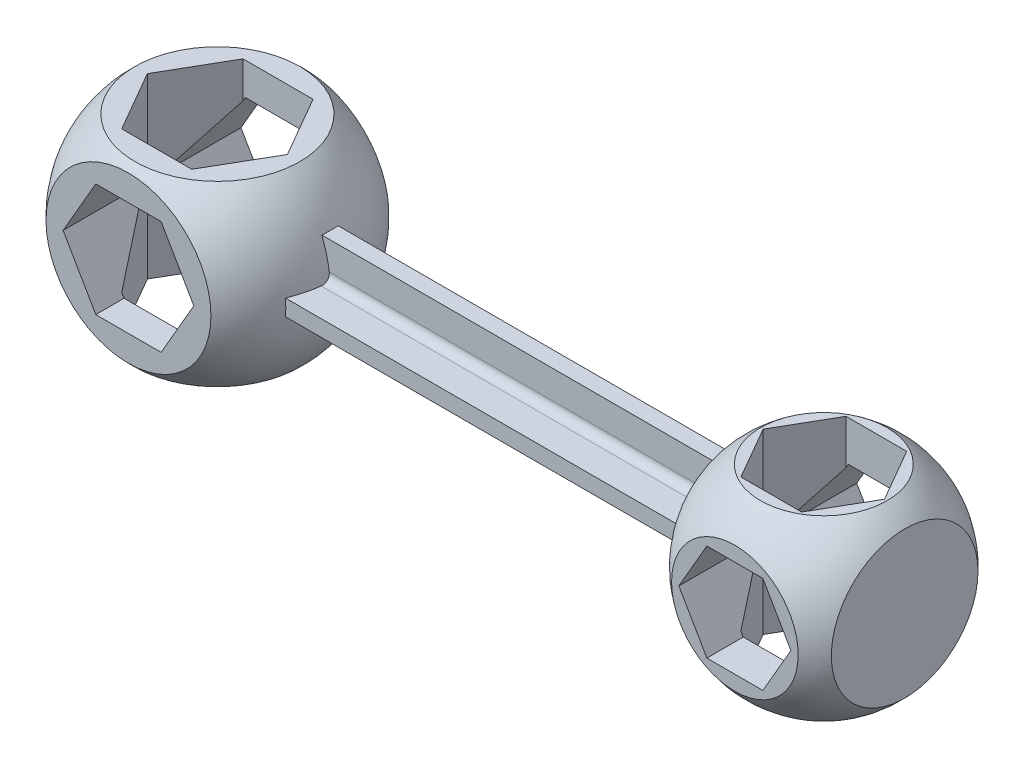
ISO-10303-21;
HEADER;
FILE_DESCRIPTION(('STEP AP214'),'2;1');
FILE_NAME('part.step','',(''),(''),'','','');
FILE_SCHEMA(('AUTOMOTIVE_DESIGN { 1 0 10303 214 1 1 1 1 }'));
ENDSEC;
DATA;
#1=APPLICATION_CONTEXT('core data for automotive mechanical design processes');
#2=APPLICATION_PROTOCOL_DEFINITION('international standard','automotive_design',2000,#1);
#3=PRODUCT_CONTEXT('',#1,'mechanical');
#4=PRODUCT('Part','Part','',(#3));
#5=PRODUCT_RELATED_PRODUCT_CATEGORY('part','',(#4));
#6=PRODUCT_DEFINITION_FORMATION('','',#4);
#7=PRODUCT_DEFINITION_CONTEXT('part definition',#1,'design');
#8=PRODUCT_DEFINITION('design','',#6,#7);
#9=PRODUCT_DEFINITION_SHAPE('','',#8);
#10=(LENGTH_UNIT() NAMED_UNIT(*) SI_UNIT(.MILLI.,.METRE.));
#11=(NAMED_UNIT(*) PLANE_ANGLE_UNIT() SI_UNIT($,.RADIAN.));
#12=(NAMED_UNIT(*) SI_UNIT($,.STERADIAN.) SOLID_ANGLE_UNIT());
#13=UNCERTAINTY_MEASURE_WITH_UNIT(LENGTH_MEASURE(1.E-05),#10,'distance_accuracy_value','');
#14=(GEOMETRIC_REPRESENTATION_CONTEXT(3) GLOBAL_UNCERTAINTY_ASSIGNED_CONTEXT((#13)) GLOBAL_UNIT_ASSIGNED_CONTEXT((#10,
#11,#12)) REPRESENTATION_CONTEXT('',''));
#15=CARTESIAN_POINT('',(0.,0.,0.));
#16=DIRECTION('',(0.,0.,1.));
#17=DIRECTION('',(1.,0.,0.));
#18=AXIS2_PLACEMENT_3D('',#15,#16,#17);
#19=CARTESIAN_POINT('',(71.2472232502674,-15.,6.50000000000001));
#20=DIRECTION('',(0.,0.,1.));
#21=DIRECTION('',(1.,0.,0.));
#22=AXIS2_PLACEMENT_3D('',#19,#20,#21);
#23=PLANE('',#22);
#24=DIRECTION('',(1.,0.,0.));
#25=VECTOR('',#24,1.);
#26=CARTESIAN_POINT('',(71.2472232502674,-6.00000000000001,6.50000000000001));
#27=LINE('',#26,#25);
#28=CARTESIAN_POINT('',(71.5358983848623,-6.00000000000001,6.50000000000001));
#29=VERTEX_POINT('',#28);
#30=CARTESIAN_POINT('',(78.4641016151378,-6.00000000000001,6.50000000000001));
#31=VERTEX_POINT('',#30);
#32=EDGE_CURVE('E548',#29,#31,#27,.T.);
#33=ORIENTED_EDGE('',*,*,#32,.T.);
#34=DIRECTION('',(0.5,0.866025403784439,0.));
#35=VECTOR('',#34,1.);
#36=CARTESIAN_POINT('',(72.7627677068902,-15.875,6.50000000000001));
#37=LINE('',#36,#35);
#38=CARTESIAN_POINT('',(78.7527767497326,-5.5,6.50000000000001));
#39=VERTEX_POINT('',#38);
#40=EDGE_CURVE('E501',#31,#39,#37,.T.);
#41=ORIENTED_EDGE('',*,*,#40,.T.);
#42=DIRECTION('',(0.,1.,0.));
#43=VECTOR('',#42,1.);
#44=CARTESIAN_POINT('',(78.7527767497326,-15.,6.50000000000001));
#45=LINE('',#44,#43);
#46=CARTESIAN_POINT('',(78.7527767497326,-11.,6.50000000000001));
#47=VERTEX_POINT('',#46);
#48=EDGE_CURVE('E579',#47,#39,#45,.T.);
#49=ORIENTED_EDGE('',*,*,#48,.F.);
#50=DIRECTION('',(1.,0.,0.));
#51=VECTOR('',#50,1.);
#52=CARTESIAN_POINT('',(67.1737620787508,-11.,6.50000000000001));
#53=LINE('',#52,#51);
#54=CARTESIAN_POINT('',(71.2472232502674,-11.,6.50000000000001));
#55=VERTEX_POINT('',#54);
#56=EDGE_CURVE('E984',#55,#47,#53,.T.);
#57=ORIENTED_EDGE('',*,*,#56,.F.);
#58=DIRECTION('',(0.,1.,0.));
#59=VECTOR('',#58,1.);
#60=CARTESIAN_POINT('',(71.2472232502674,-15.,6.50000000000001));
#61=LINE('',#60,#59);
#62=CARTESIAN_POINT('',(71.2472232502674,-5.50000000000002,6.50000000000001));
#63=VERTEX_POINT('',#62);
#64=EDGE_CURVE('E585',#55,#63,#61,.T.);
#65=ORIENTED_EDGE('',*,*,#64,.T.);
#66=DIRECTION('',(0.5,-0.866025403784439,0.));
#67=VECTOR('',#66,1.);
#68=CARTESIAN_POINT('',(75.3608439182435,-12.625,6.50000000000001));
#69=LINE('',#68,#67);
#70=EDGE_CURVE('E541',#63,#29,#69,.T.);
#71=ORIENTED_EDGE('',*,*,#70,.T.);
#72=EDGE_LOOP('',(#33,#41,#49,#57,#65,#71));
#73=FACE_BOUND('',#72,.T.);
#74=ADVANCED_FACE('F39',(#73),#23,.F.);
#75=CARTESIAN_POINT('',(78.7527767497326,-15.,-6.5));
#76=DIRECTION('',(0.,0.,-1.));
#77=DIRECTION('',(-1.,0.,0.));
#78=AXIS2_PLACEMENT_3D('',#75,#76,#77);
#79=PLANE('',#78);
#80=DIRECTION('',(0.,1.,0.));
#81=VECTOR('',#80,1.);
#82=CARTESIAN_POINT('',(78.7527767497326,-15.,-6.5));
#83=LINE('',#82,#81);
#84=CARTESIAN_POINT('',(78.7527767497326,-11.,-6.5));
#85=VERTEX_POINT('',#84);
#86=CARTESIAN_POINT('',(78.7527767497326,-5.50000000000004,-6.5));
#87=VERTEX_POINT('',#86);
#88=EDGE_CURVE('E598',#85,#87,#83,.T.);
#89=ORIENTED_EDGE('',*,*,#88,.T.);
#90=DIRECTION('',(-0.5,-0.866025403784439,0.));
#91=VECTOR('',#90,1.);
#92=CARTESIAN_POINT('',(74.6391560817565,-12.625,-6.50000000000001));
#93=LINE('',#92,#91);
#94=CARTESIAN_POINT('',(78.4641016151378,-6.00000000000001,-6.5));
#95=VERTEX_POINT('',#94);
#96=EDGE_CURVE('E497',#87,#95,#93,.T.);
#97=ORIENTED_EDGE('',*,*,#96,.T.);
#98=DIRECTION('',(-1.,0.,0.));
#99=VECTOR('',#98,1.);
#100=CARTESIAN_POINT('',(78.7527767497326,-6.00000000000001,-6.5));
#101=LINE('',#100,#99);
#102=CARTESIAN_POINT('',(71.5358983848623,-6.00000000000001,-6.5));
#103=VERTEX_POINT('',#102);
#104=EDGE_CURVE('E1012',#95,#103,#101,.T.);
#105=ORIENTED_EDGE('',*,*,#104,.T.);
#106=DIRECTION('',(-0.5,0.866025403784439,0.));
#107=VECTOR('',#106,1.);
#108=CARTESIAN_POINT('',(77.2372322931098,-15.875,-6.5));
#109=LINE('',#108,#107);
#110=CARTESIAN_POINT('',(71.2472232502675,-5.50000000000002,-6.50000000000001));
#111=VERTEX_POINT('',#110);
#112=EDGE_CURVE('E1008',#103,#111,#109,.T.);
#113=ORIENTED_EDGE('',*,*,#112,.T.);
#114=DIRECTION('',(0.,1.,0.));
#115=VECTOR('',#114,1.);
#116=CARTESIAN_POINT('',(71.2472232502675,-15.,-6.50000000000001));
#117=LINE('',#116,#115);
#118=CARTESIAN_POINT('',(71.2472232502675,-11.,-6.50000000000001));
#119=VERTEX_POINT('',#118);
#120=EDGE_CURVE('E593',#119,#111,#117,.T.);
#121=ORIENTED_EDGE('',*,*,#120,.F.);
#122=DIRECTION('',(-1.,0.,0.));
#123=VECTOR('',#122,1.);
#124=CARTESIAN_POINT('',(67.1737620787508,-11.,-6.50000000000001));
#125=LINE('',#124,#123);
#126=EDGE_CURVE('E972',#85,#119,#125,.T.);
#127=ORIENTED_EDGE('',*,*,#126,.F.);
#128=EDGE_LOOP('',(#89,#97,#105,#113,#121,#127));
#129=FACE_BOUND('',#128,.T.);
#130=ADVANCED_FACE('F1205',(#129),#79,.F.);
#131=CARTESIAN_POINT('',(4.3301270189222,-15.,-7.5));
#132=DIRECTION('',(0.,0.,-1.));
#133=DIRECTION('',(-1.,0.,0.));
#134=AXIS2_PLACEMENT_3D('',#131,#132,#133);
#135=PLANE('',#134);
#136=DIRECTION('',(0.,1.,0.));
#137=VECTOR('',#136,1.);
#138=CARTESIAN_POINT('',(4.3301270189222,-15.,-7.5));
#139=LINE('',#138,#137);
#140=CARTESIAN_POINT('',(4.3301270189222,-11.,-7.5));
#141=VERTEX_POINT('',#140);
#142=CARTESIAN_POINT('',(4.3301270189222,-6.5,-7.5));
#143=VERTEX_POINT('',#142);
#144=EDGE_CURVE('E758',#141,#143,#139,.T.);
#145=ORIENTED_EDGE('',*,*,#144,.T.);
#146=DIRECTION('',(-0.5,-0.866025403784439,0.));
#147=VECTOR('',#146,1.);
#148=CARTESIAN_POINT('',(0.649519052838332,-12.875,-7.5));
#149=LINE('',#148,#147);
#150=CARTESIAN_POINT('',(4.04145188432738,-7.,-7.5));
#151=VERTEX_POINT('',#150);
#152=EDGE_CURVE('E721',#143,#151,#149,.T.);
#153=ORIENTED_EDGE('',*,*,#152,.T.);
#154=DIRECTION('',(-1.,0.,0.));
#155=VECTOR('',#154,1.);
#156=CARTESIAN_POINT('',(4.3301270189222,-7.,-7.5));
#157=LINE('',#156,#155);
#158=CARTESIAN_POINT('',(-4.04145188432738,-7.,-7.5));
#159=VERTEX_POINT('',#158);
#160=EDGE_CURVE('E706',#151,#159,#157,.T.);
#161=ORIENTED_EDGE('',*,*,#160,.T.);
#162=DIRECTION('',(-0.5,0.866025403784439,0.));
#163=VECTOR('',#162,1.);
#164=CARTESIAN_POINT('',(1.51554445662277,-16.625,-7.5));
#165=LINE('',#164,#163);
#166=CARTESIAN_POINT('',(-4.33012701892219,-6.5,-7.5));
#167=VERTEX_POINT('',#166);
#168=EDGE_CURVE('E672',#159,#167,#165,.T.);
#169=ORIENTED_EDGE('',*,*,#168,.T.);
#170=DIRECTION('',(0.,1.,0.));
#171=VECTOR('',#170,1.);
#172=CARTESIAN_POINT('',(-4.33012701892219,-15.,-7.5));
#173=LINE('',#172,#171);
#174=CARTESIAN_POINT('',(-4.33012701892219,-11.,-7.5));
#175=VERTEX_POINT('',#174);
#176=EDGE_CURVE('E752',#175,#167,#173,.T.);
#177=ORIENTED_EDGE('',*,*,#176,.F.);
#178=DIRECTION('',(-1.,0.,0.));
#179=VECTOR('',#178,1.);
#180=CARTESIAN_POINT('',(10.1980390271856,-11.,-7.5));
#181=LINE('',#180,#179);
#182=EDGE_CURVE('E794',#141,#175,#181,.T.);
#183=ORIENTED_EDGE('',*,*,#182,.F.);
#184=EDGE_LOOP('',(#145,#153,#161,#169,#177,#183));
#185=FACE_BOUND('',#184,.T.);
#186=ADVANCED_FACE('F1212',(#185),#135,.F.);
#187=CARTESIAN_POINT('',(-4.33012701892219,-15.,7.5));
#188=DIRECTION('',(0.,0.,1.));
#189=DIRECTION('',(1.,0.,0.));
#190=AXIS2_PLACEMENT_3D('',#187,#188,#189);
#191=PLANE('',#190);
#192=DIRECTION('',(1.,0.,0.));
#193=VECTOR('',#192,1.);
#194=CARTESIAN_POINT('',(-4.33012701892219,-7.,7.5));
#195=LINE('',#194,#193);
#196=CARTESIAN_POINT('',(-4.04145188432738,-7.,7.5));
#197=VERTEX_POINT('',#196);
#198=CARTESIAN_POINT('',(4.04145188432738,-7.,7.5));
#199=VERTEX_POINT('',#198);
#200=EDGE_CURVE('E960',#197,#199,#195,.T.);
#201=ORIENTED_EDGE('',*,*,#200,.T.);
#202=DIRECTION('',(0.5,0.866025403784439,0.));
#203=VECTOR('',#202,1.);
#204=CARTESIAN_POINT('',(-1.51554445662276,-16.625,7.5));
#205=LINE('',#204,#203);
#206=CARTESIAN_POINT('',(4.33012701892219,-6.50000000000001,7.5));
#207=VERTEX_POINT('',#206);
#208=EDGE_CURVE('E964',#199,#207,#205,.T.);
#209=ORIENTED_EDGE('',*,*,#208,.T.);
#210=DIRECTION('',(0.,1.,0.));
#211=VECTOR('',#210,1.);
#212=CARTESIAN_POINT('',(4.33012701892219,-15.,7.5));
#213=LINE('',#212,#211);
#214=CARTESIAN_POINT('',(4.33012701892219,-11.,7.5));
#215=VERTEX_POINT('',#214);
#216=EDGE_CURVE('E766',#215,#207,#213,.T.);
#217=ORIENTED_EDGE('',*,*,#216,.F.);
#218=DIRECTION('',(1.,0.,0.));
#219=VECTOR('',#218,1.);
#220=CARTESIAN_POINT('',(10.1980390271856,-11.,7.5));
#221=LINE('',#220,#219);
#222=CARTESIAN_POINT('',(-4.33012701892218,-11.,7.5));
#223=VERTEX_POINT('',#222);
#224=EDGE_CURVE('E782',#223,#215,#221,.T.);
#225=ORIENTED_EDGE('',*,*,#224,.F.);
#226=DIRECTION('',(0.,1.,0.));
#227=VECTOR('',#226,1.);
#228=CARTESIAN_POINT('',(-4.33012701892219,-15.,7.5));
#229=LINE('',#228,#227);
#230=CARTESIAN_POINT('',(-4.33012701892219,-6.5,7.5));
#231=VERTEX_POINT('',#230);
#232=EDGE_CURVE('E771',#223,#231,#229,.T.);
#233=ORIENTED_EDGE('',*,*,#232,.T.);
#234=DIRECTION('',(0.5,-0.866025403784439,0.));
#235=VECTOR('',#234,1.);
#236=CARTESIAN_POINT('',(-0.649519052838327,-12.875,7.5));
#237=LINE('',#236,#235);
#238=EDGE_CURVE('E668',#231,#197,#237,.T.);
#239=ORIENTED_EDGE('',*,*,#238,.T.);
#240=EDGE_LOOP('',(#201,#209,#217,#225,#233,#239));
#241=FACE_BOUND('',#240,.T.);
#242=ADVANCED_FACE('F1097',(#241),#191,.F.);
#243=CARTESIAN_POINT('',(0.,0.,0.));
#244=DIRECTION('',(1.,0.,0.));
#245=DIRECTION('',(0.,0.,1.));
#246=AXIS2_PLACEMENT_3D('',#243,#244,#245);
#247=SPHERICAL_SURFACE('',#246,15.);
#248=CARTESIAN_POINT('',(0.,0.,-11.));
#249=DIRECTION('',(0.,0.,-1.));
#250=DIRECTION('',(-1.,0.,0.));
#251=AXIS2_PLACEMENT_3D('',#248,#249,#250);
#252=CIRCLE('',#251,10.1980390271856);
#253=CARTESIAN_POINT('',(-10.1980390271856,0.,-11.));
#254=VERTEX_POINT('',#253);
#255=EDGE_CURVE('E808',#254,#254,#252,.F.);
#256=ORIENTED_EDGE('',*,*,#255,.T.);
#257=EDGE_LOOP('',(#256));
#258=FACE_BOUND('',#257,.T.);
#259=CARTESIAN_POINT('',(-13.,0.,0.));
#260=DIRECTION('',(-1.,0.,0.));
#261=DIRECTION('',(0.,0.,1.));
#262=AXIS2_PLACEMENT_3D('',#259,#260,#261);
#263=CIRCLE('',#262,7.48331477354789);
#264=CARTESIAN_POINT('',(-13.,0.,7.48331477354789));
#265=VERTEX_POINT('',#264);
#266=EDGE_CURVE('E937',#265,#265,#263,.F.);
#267=ORIENTED_EDGE('',*,*,#266,.T.);
#268=EDGE_LOOP('',(#267));
#269=FACE_BOUND('',#268,.T.);
#270=CARTESIAN_POINT('',(0.,11.,0.));
#271=DIRECTION('',(0.,-1.,0.));
#272=DIRECTION('',(0.,0.,-1.));
#273=AXIS2_PLACEMENT_3D('',#270,#271,#272);
#274=CIRCLE('',#273,10.1980390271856);
#275=CARTESIAN_POINT('',(0.,11.,-10.1980390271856));
#276=VERTEX_POINT('',#275);
#277=EDGE_CURVE('E926',#276,#276,#274,.F.);
#278=ORIENTED_EDGE('',*,*,#277,.F.);
#279=EDGE_LOOP('',(#278));
#280=FACE_BOUND('',#279,.T.);
#281=CARTESIAN_POINT('',(0.,-11.,0.));
#282=DIRECTION('',(0.,1.,0.));
#283=DIRECTION('',(0.,0.,1.));
#284=AXIS2_PLACEMENT_3D('',#281,#282,#283);
#285=CIRCLE('',#284,10.1980390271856);
#286=CARTESIAN_POINT('',(0.,-11.,10.1980390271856));
#287=VERTEX_POINT('',#286);
#288=EDGE_CURVE('E922',#287,#287,#285,.F.);
#289=ORIENTED_EDGE('',*,*,#288,.F.);
#290=EDGE_LOOP('',(#289));
#291=FACE_BOUND('',#290,.T.);
#292=CARTESIAN_POINT('',(0.,1.,0.));
#293=DIRECTION('',(0.,1.,0.));
#294=DIRECTION('',(0.,0.,1.));
#295=AXIS2_PLACEMENT_3D('',#292,#293,#294);
#296=CIRCLE('',#295,14.9666295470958);
#297=CARTESIAN_POINT('',(14.8323969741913,1.,2.));
#298=VERTEX_POINT('',#297);
#299=CARTESIAN_POINT('',(13.9194109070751,1.,5.5));
#300=VERTEX_POINT('',#299);
#301=EDGE_CURVE('E903',#298,#300,#296,.F.);
#302=ORIENTED_EDGE('',*,*,#301,.F.);
#303=CARTESIAN_POINT('',(14.8323969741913,1.,2.));
#304=CARTESIAN_POINT('',(14.8361416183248,1.00000022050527,1.97222875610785));
#305=CARTESIAN_POINT('',(14.8397299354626,1.00115763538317,1.94444915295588));
#306=CARTESIAN_POINT('',(14.8465721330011,1.00578579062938,1.88904110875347));
#307=CARTESIAN_POINT('',(14.8498260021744,1.00925660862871,1.86141267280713));
#308=CARTESIAN_POINT('',(14.8590456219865,1.02312650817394,1.77907374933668));
#309=CARTESIAN_POINT('',(14.8644783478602,1.03698304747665,1.72484313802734));
#310=CARTESIAN_POINT('',(14.8737470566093,1.07360876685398,1.61930877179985));
#311=CARTESIAN_POINT('',(14.8775816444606,1.0963857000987,1.56800760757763));
#312=CARTESIAN_POINT('',(14.8835335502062,1.15024119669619,1.46986830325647));
#313=CARTESIAN_POINT('',(14.885651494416,1.18131672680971,1.4230285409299));
#314=CARTESIAN_POINT('',(14.8880938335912,1.25055822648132,1.33560764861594));
#315=CARTESIAN_POINT('',(14.8884353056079,1.28865302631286,1.29497058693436));
#316=CARTESIAN_POINT('',(14.8873604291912,1.37104623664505,1.22057869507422));
#317=CARTESIAN_POINT('',(14.88594383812,1.41534550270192,1.18682481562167));
#318=CARTESIAN_POINT('',(14.8814060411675,1.50865404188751,1.1272857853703));
#319=CARTESIAN_POINT('',(14.8782921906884,1.55764224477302,1.10146699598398));
#320=CARTESIAN_POINT('',(14.8704570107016,1.65909027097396,1.0582906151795));
#321=CARTESIAN_POINT('',(14.8657361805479,1.71154901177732,1.04093039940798));
#322=CARTESIAN_POINT('',(14.8563511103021,1.80352294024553,1.01868882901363));
#323=CARTESIAN_POINT('',(14.8520372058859,1.84257448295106,1.01167867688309));
#324=CARTESIAN_POINT('',(14.8427190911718,1.92109440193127,1.00233350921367));
#325=CARTESIAN_POINT('',(14.8377158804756,1.96056209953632,0.999991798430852));
#326=CARTESIAN_POINT('',(14.8323969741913,2.,0.999999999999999));
#327=B_SPLINE_CURVE_WITH_KNOTS('',3,(#303,#304,#305,#306,#307,#308,#309,#310,#311,#312,#313,
#314,#315,#316,#317,#318,#319,#320,#321,#322,#323,#324,#325,#326),.UNSPECIFIED.,.F.,.F.,(4,2,2,
2,2,2,2,2,2,2,2,4),(0.,0.0840178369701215,0.168038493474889,0.335881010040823,0.503869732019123,
0.671797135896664,0.838107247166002,1.00444031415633,1.17005821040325,1.33562468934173,
1.45508490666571,1.5743736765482),.UNSPECIFIED.);
#328=CARTESIAN_POINT('',(14.8323969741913,2.,0.999999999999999));
#329=VERTEX_POINT('',#328);
#330=EDGE_CURVE('E1083',#298,#329,#327,.T.);
#331=ORIENTED_EDGE('',*,*,#330,.T.);
#332=CARTESIAN_POINT('',(0.,0.,0.999999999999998));
#333=DIRECTION('',(0.,0.,-1.));
#334=DIRECTION('',(0.,1.,0.));
#335=AXIS2_PLACEMENT_3D('',#332,#333,#334);
#336=CIRCLE('',#335,14.9666295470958);
#337=CARTESIAN_POINT('',(13.9194109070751,5.5,1.));
#338=VERTEX_POINT('',#337);
#339=EDGE_CURVE('E878',#329,#338,#336,.F.);
#340=ORIENTED_EDGE('',*,*,#339,.T.);
#341=CARTESIAN_POINT('',(0.,5.5,0.));
#342=DIRECTION('',(0.,1.,0.));
#343=DIRECTION('',(0.,0.,1.));
#344=AXIS2_PLACEMENT_3D('',#341,#342,#343);
#345=CIRCLE('',#344,13.9552857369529);
#346=CARTESIAN_POINT('',(13.9194109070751,5.5,-1.));
#347=VERTEX_POINT('',#346);
#348=EDGE_CURVE('E891',#347,#338,#345,.F.);
#349=ORIENTED_EDGE('',*,*,#348,.F.);
#350=CARTESIAN_POINT('',(0.,0.,-1.));
#351=DIRECTION('',(0.,0.,-1.));
#352=DIRECTION('',(0.,1.,0.));
#353=AXIS2_PLACEMENT_3D('',#350,#351,#352);
#354=CIRCLE('',#353,14.9666295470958);
#355=CARTESIAN_POINT('',(14.8323969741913,2.,-1.));
#356=VERTEX_POINT('',#355);
#357=EDGE_CURVE('E886',#356,#347,#354,.F.);
#358=ORIENTED_EDGE('',*,*,#357,.F.);
#359=CARTESIAN_POINT('',(14.8323969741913,2.,-1.));
#360=CARTESIAN_POINT('',(14.8361416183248,1.97222875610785,-1.00000022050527));
#361=CARTESIAN_POINT('',(14.8397299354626,1.94444915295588,-1.00115763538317));
#362=CARTESIAN_POINT('',(14.8465721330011,1.88904110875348,-1.00578579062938));
#363=CARTESIAN_POINT('',(14.8498260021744,1.86141267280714,-1.00925660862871));
#364=CARTESIAN_POINT('',(14.8590456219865,1.77907374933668,-1.02312650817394));
#365=CARTESIAN_POINT('',(14.8644783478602,1.72484313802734,-1.03698304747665));
#366=CARTESIAN_POINT('',(14.8737470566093,1.61930877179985,-1.07360876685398));
#367=CARTESIAN_POINT('',(14.8775816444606,1.56800760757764,-1.0963857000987));
#368=CARTESIAN_POINT('',(14.8835335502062,1.46986830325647,-1.15024119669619));
#369=CARTESIAN_POINT('',(14.885651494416,1.4230285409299,-1.18131672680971));
#370=CARTESIAN_POINT('',(14.8880938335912,1.33560764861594,-1.25055822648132));
#371=CARTESIAN_POINT('',(14.8884353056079,1.29497058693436,-1.28865302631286));
#372=CARTESIAN_POINT('',(14.8873604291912,1.22057869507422,-1.37104623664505));
#373=CARTESIAN_POINT('',(14.88594383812,1.18682481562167,-1.41534550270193));
#374=CARTESIAN_POINT('',(14.8814060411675,1.1272857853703,-1.50865404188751));
#375=CARTESIAN_POINT('',(14.8782921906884,1.10146699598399,-1.55764224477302));
#376=CARTESIAN_POINT('',(14.8704570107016,1.05829061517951,-1.65909027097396));
#377=CARTESIAN_POINT('',(14.8657361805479,1.04093039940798,-1.71154901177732));
#378=CARTESIAN_POINT('',(14.8563511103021,1.01868882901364,-1.80352294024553));
#379=CARTESIAN_POINT('',(14.8520372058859,1.01167867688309,-1.84257448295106));
#380=CARTESIAN_POINT('',(14.8427190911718,1.00233350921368,-1.92109440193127));
#381=CARTESIAN_POINT('',(14.8377158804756,0.999991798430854,-1.96056209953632));
#382=CARTESIAN_POINT('',(14.8323969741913,1.,-2.));
#383=B_SPLINE_CURVE_WITH_KNOTS('',3,(#359,#360,#361,#362,#363,#364,#365,#366,#367,#368,#369,
#370,#371,#372,#373,#374,#375,#376,#377,#378,#379,#380,#381,#382),.UNSPECIFIED.,.F.,.F.,(4,2,2,
2,2,2,2,2,2,2,2,4),(0.,0.0840178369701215,0.168038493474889,0.335881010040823,0.503869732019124,
0.671797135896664,0.838107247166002,1.00444031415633,1.17005821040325,1.33562468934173,
1.45508490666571,1.5743736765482),.UNSPECIFIED.);
#384=CARTESIAN_POINT('',(14.8323969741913,1.,-2.));
#385=VERTEX_POINT('',#384);
#386=EDGE_CURVE('E1075',#356,#385,#383,.T.);
#387=ORIENTED_EDGE('',*,*,#386,.T.);
#388=CARTESIAN_POINT('',(13.9194109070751,1.,-5.5));
#389=VERTEX_POINT('',#388);
#390=EDGE_CURVE('E906',#389,#385,#296,.F.);
#391=ORIENTED_EDGE('',*,*,#390,.F.);
#392=CARTESIAN_POINT('',(0.,0.,-5.5));
#393=DIRECTION('',(0.,0.,-1.));
#394=DIRECTION('',(-1.,0.,0.));
#395=AXIS2_PLACEMENT_3D('',#392,#393,#394);
#396=CIRCLE('',#395,13.9552857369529);
#397=CARTESIAN_POINT('',(13.9194109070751,-0.999999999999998,-5.5));
#398=VERTEX_POINT('',#397);
#399=EDGE_CURVE('E907',#398,#389,#396,.F.);
#400=ORIENTED_EDGE('',*,*,#399,.F.);
#401=CARTESIAN_POINT('',(0.,-0.999999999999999,0.));
#402=DIRECTION('',(0.,1.,0.));
#403=DIRECTION('',(0.,0.,1.));
#404=AXIS2_PLACEMENT_3D('',#401,#402,#403);
#405=CIRCLE('',#404,14.9666295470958);
#406=CARTESIAN_POINT('',(14.8323969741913,-0.999999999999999,-2.));
#407=VERTEX_POINT('',#406);
#408=EDGE_CURVE('E899',#398,#407,#405,.F.);
#409=ORIENTED_EDGE('',*,*,#408,.T.);
#410=CARTESIAN_POINT('',(14.8323969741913,-0.999999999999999,-2.));
#411=CARTESIAN_POINT('',(14.8361416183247,-1.00000022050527,-1.97222875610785));
#412=CARTESIAN_POINT('',(14.8397299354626,-1.00115763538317,-1.94444915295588));
#413=CARTESIAN_POINT('',(14.8465721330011,-1.00578579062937,-1.88904110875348));
#414=CARTESIAN_POINT('',(14.8498260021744,-1.00925660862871,-1.86141267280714));
#415=CARTESIAN_POINT('',(14.8590456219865,-1.02312650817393,-1.77907374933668));
#416=CARTESIAN_POINT('',(14.8644783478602,-1.03698304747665,-1.72484313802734));
#417=CARTESIAN_POINT('',(14.8737470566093,-1.07360876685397,-1.61930877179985));
#418=CARTESIAN_POINT('',(14.8775816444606,-1.0963857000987,-1.56800760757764));
#419=CARTESIAN_POINT('',(14.8835335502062,-1.15024119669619,-1.46986830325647));
#420=CARTESIAN_POINT('',(14.885651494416,-1.18131672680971,-1.4230285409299));
#421=CARTESIAN_POINT('',(14.8880938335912,-1.25055822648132,-1.33560764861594));
#422=CARTESIAN_POINT('',(14.8884353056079,-1.28865302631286,-1.29497058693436));
#423=CARTESIAN_POINT('',(14.8873604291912,-1.37104623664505,-1.22057869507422));
#424=CARTESIAN_POINT('',(14.88594383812,-1.41534550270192,-1.18682481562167));
#425=CARTESIAN_POINT('',(14.8814060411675,-1.50865404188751,-1.12728578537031));
#426=CARTESIAN_POINT('',(14.8782921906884,-1.55764224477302,-1.10146699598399));
#427=CARTESIAN_POINT('',(14.8704570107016,-1.65909027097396,-1.05829061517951));
#428=CARTESIAN_POINT('',(14.8657361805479,-1.71154901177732,-1.04093039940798));
#429=CARTESIAN_POINT('',(14.8563511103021,-1.80352294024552,-1.01868882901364));
#430=CARTESIAN_POINT('',(14.8520372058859,-1.84257448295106,-1.01167867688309));
#431=CARTESIAN_POINT('',(14.8427190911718,-1.92109440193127,-1.00233350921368));
#432=CARTESIAN_POINT('',(14.8377158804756,-1.96056209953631,-0.999991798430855));
#433=CARTESIAN_POINT('',(14.8323969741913,-2.,-1.));
#434=B_SPLINE_CURVE_WITH_KNOTS('',3,(#410,#411,#412,#413,#414,#415,#416,#417,#418,#419,#420,
#421,#422,#423,#424,#425,#426,#427,#428,#429,#430,#431,#432,#433),.UNSPECIFIED.,.F.,.F.,(4,2,2,
2,2,2,2,2,2,2,2,4),(0.,0.0840178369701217,0.168038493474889,0.335881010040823,0.503869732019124,
0.671797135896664,0.838107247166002,1.00444031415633,1.17005821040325,1.33562468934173,
1.45508490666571,1.5743736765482),.UNSPECIFIED.);
#435=CARTESIAN_POINT('',(14.8323969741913,-2.,-1.));
#436=VERTEX_POINT('',#435);
#437=EDGE_CURVE('E1103',#407,#436,#434,.T.);
#438=ORIENTED_EDGE('',*,*,#437,.T.);
#439=CARTESIAN_POINT('',(13.9194109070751,-5.5,-1.));
#440=VERTEX_POINT('',#439);
#441=EDGE_CURVE('E887',#440,#436,#354,.F.);
#442=ORIENTED_EDGE('',*,*,#441,.F.);
#443=CARTESIAN_POINT('',(0.,-5.5,0.));
#444=DIRECTION('',(0.,-1.,0.));
#445=DIRECTION('',(0.,0.,-1.));
#446=AXIS2_PLACEMENT_3D('',#443,#444,#445);
#447=CIRCLE('',#446,13.9552857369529);
#448=CARTESIAN_POINT('',(13.9194109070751,-5.5,0.999999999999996));
#449=VERTEX_POINT('',#448);
#450=EDGE_CURVE('E882',#449,#440,#447,.F.);
#451=ORIENTED_EDGE('',*,*,#450,.F.);
#452=CARTESIAN_POINT('',(14.8323969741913,-2.,0.999999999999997));
#453=VERTEX_POINT('',#452);
#454=EDGE_CURVE('E879',#449,#453,#336,.F.);
#455=ORIENTED_EDGE('',*,*,#454,.T.);
#456=CARTESIAN_POINT('',(14.8323969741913,-2.,0.999999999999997));
#457=CARTESIAN_POINT('',(14.8361416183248,-1.97222875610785,1.00000022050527));
#458=CARTESIAN_POINT('',(14.8397299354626,-1.94444915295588,1.00115763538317));
#459=CARTESIAN_POINT('',(14.8465721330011,-1.88904110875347,1.00578579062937));
#460=CARTESIAN_POINT('',(14.8498260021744,-1.86141267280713,1.00925660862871));
#461=CARTESIAN_POINT('',(14.8590456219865,-1.77907374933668,1.02312650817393));
#462=CARTESIAN_POINT('',(14.8644783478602,-1.72484313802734,1.03698304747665));
#463=CARTESIAN_POINT('',(14.8737470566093,-1.61930877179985,1.07360876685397));
#464=CARTESIAN_POINT('',(14.8775816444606,-1.56800760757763,1.0963857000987));
#465=CARTESIAN_POINT('',(14.8835335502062,-1.46986830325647,1.15024119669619));
#466=CARTESIAN_POINT('',(14.885651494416,-1.4230285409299,1.18131672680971));
#467=CARTESIAN_POINT('',(14.8880938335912,-1.33560764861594,1.25055822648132));
#468=CARTESIAN_POINT('',(14.8884353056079,-1.29497058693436,1.28865302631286));
#469=CARTESIAN_POINT('',(14.8873604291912,-1.22057869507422,1.37104623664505));
#470=CARTESIAN_POINT('',(14.88594383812,-1.18682481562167,1.41534550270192));
#471=CARTESIAN_POINT('',(14.8814060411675,-1.1272857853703,1.50865404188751));
#472=CARTESIAN_POINT('',(14.8782921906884,-1.10146699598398,1.55764224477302));
#473=CARTESIAN_POINT('',(14.8704570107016,-1.0582906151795,1.65909027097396));
#474=CARTESIAN_POINT('',(14.8657361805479,-1.04093039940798,1.71154901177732));
#475=CARTESIAN_POINT('',(14.8563511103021,-1.01868882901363,1.80352294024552));
#476=CARTESIAN_POINT('',(14.8520372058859,-1.01167867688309,1.84257448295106));
#477=CARTESIAN_POINT('',(14.8427190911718,-1.00233350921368,1.92109440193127));
#478=CARTESIAN_POINT('',(14.8377158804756,-0.999991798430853,1.96056209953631));
#479=CARTESIAN_POINT('',(14.8323969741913,-1.,2.));
#480=B_SPLINE_CURVE_WITH_KNOTS('',3,(#456,#457,#458,#459,#460,#461,#462,#463,#464,#465,#466,
#467,#468,#469,#470,#471,#472,#473,#474,#475,#476,#477,#478,#479),.UNSPECIFIED.,.F.,.F.,(4,2,2,
2,2,2,2,2,2,2,2,4),(0.,0.0840178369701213,0.168038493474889,0.335881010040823,0.503869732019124,
0.671797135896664,0.838107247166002,1.00444031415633,1.17005821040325,1.33562468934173,
1.45508490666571,1.5743736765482),.UNSPECIFIED.);
#481=CARTESIAN_POINT('',(14.8323969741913,-0.999999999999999,2.));
#482=VERTEX_POINT('',#481);
#483=EDGE_CURVE('E64',#453,#482,#480,.T.);
#484=ORIENTED_EDGE('',*,*,#483,.T.);
#485=CARTESIAN_POINT('',(13.9194109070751,-1.,5.5));
#486=VERTEX_POINT('',#485);
#487=EDGE_CURVE('E895',#482,#486,#405,.F.);
#488=ORIENTED_EDGE('',*,*,#487,.T.);
#489=CARTESIAN_POINT('',(0.,0.,5.5));
#490=DIRECTION('',(0.,0.,1.));
#491=DIRECTION('',(1.,0.,0.));
#492=AXIS2_PLACEMENT_3D('',#489,#490,#491);
#493=CIRCLE('',#492,13.9552857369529);
#494=EDGE_CURVE('E898',#300,#486,#493,.F.);
#495=ORIENTED_EDGE('',*,*,#494,.F.);
#496=EDGE_LOOP('',(#302,#331,#340,#349,#358,#387,#391,#400,#409,#438,#442,#451,#455,#484,#488,#495));
#497=FACE_BOUND('',#496,.T.);
#498=CARTESIAN_POINT('',(0.,0.,11.));
#499=DIRECTION('',(0.,0.,1.));
#500=DIRECTION('',(1.,0.,0.));
#501=AXIS2_PLACEMENT_3D('',#498,#499,#500);
#502=CIRCLE('',#501,10.1980390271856);
#503=CARTESIAN_POINT('',(10.1980390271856,0.,11.));
#504=VERTEX_POINT('',#503);
#505=EDGE_CURVE('E803',#504,#504,#502,.F.);
#506=ORIENTED_EDGE('',*,*,#505,.T.);
#507=EDGE_LOOP('',(#506));
#508=FACE_BOUND('',#507,.T.);
#509=ADVANCED_FACE('F1040',(#258,#269,#280,#291,#497,#508),#247,.T.);
#510=CARTESIAN_POINT('',(75.,0.,0.));
#511=DIRECTION('',(0.,0.,1.));
#512=DIRECTION('',(0.,1.,0.));
#513=AXIS2_PLACEMENT_3D('',#510,#511,#512);
#514=SPHERICAL_SURFACE('',#513,13.5);
#515=CARTESIAN_POINT('',(75.,0.,-11.));
#516=DIRECTION('',(0.,0.,-1.));
#517=DIRECTION('',(-1.,0.,0.));
#518=AXIS2_PLACEMENT_3D('',#515,#516,#517);
#519=CIRCLE('',#518,7.82623792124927);
#520=CARTESIAN_POINT('',(67.1737620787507,0.,-11.));
#521=VERTEX_POINT('',#520);
#522=EDGE_CURVE('E807',#521,#521,#519,.T.);
#523=ORIENTED_EDGE('',*,*,#522,.F.);
#524=EDGE_LOOP('',(#523));
#525=FACE_BOUND('',#524,.T.);
#526=CARTESIAN_POINT('',(85.,0.,0.));
#527=DIRECTION('',(1.,0.,0.));
#528=DIRECTION('',(0.,0.,-1.));
#529=AXIS2_PLACEMENT_3D('',#526,#527,#528);
#530=CIRCLE('',#529,9.06917857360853);
#531=CARTESIAN_POINT('',(85.,0.,-9.06917857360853));
#532=VERTEX_POINT('',#531);
#533=EDGE_CURVE('E930',#532,#532,#530,.T.);
#534=ORIENTED_EDGE('',*,*,#533,.F.);
#535=EDGE_LOOP('',(#534));
#536=FACE_BOUND('',#535,.T.);
#537=CARTESIAN_POINT('',(75.,-11.,0.));
#538=DIRECTION('',(0.,1.,0.));
#539=DIRECTION('',(0.,0.,1.));
#540=AXIS2_PLACEMENT_3D('',#537,#538,#539);
#541=CIRCLE('',#540,7.82623792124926);
#542=CARTESIAN_POINT('',(75.,-11.,7.82623792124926));
#543=VERTEX_POINT('',#542);
#544=EDGE_CURVE('E918',#543,#543,#541,.T.);
#545=ORIENTED_EDGE('',*,*,#544,.T.);
#546=EDGE_LOOP('',(#545));
#547=FACE_BOUND('',#546,.T.);
#548=CARTESIAN_POINT('',(75.,11.,0.));
#549=DIRECTION('',(0.,-1.,0.));
#550=DIRECTION('',(0.,0.,-1.));
#551=AXIS2_PLACEMENT_3D('',#548,#549,#550);
#552=CIRCLE('',#551,7.82623792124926);
#553=CARTESIAN_POINT('',(75.,11.,-7.82623792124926));
#554=VERTEX_POINT('',#553);
#555=EDGE_CURVE('E914',#554,#554,#552,.T.);
#556=ORIENTED_EDGE('',*,*,#555,.T.);
#557=EDGE_LOOP('',(#556));
#558=FACE_BOUND('',#557,.T.);
#559=CARTESIAN_POINT('',(75.,0.,0.999999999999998));
#560=DIRECTION('',(0.,0.,-1.));
#561=DIRECTION('',(0.,1.,0.));
#562=AXIS2_PLACEMENT_3D('',#559,#560,#561);
#563=CIRCLE('',#562,13.4629120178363);
#564=CARTESIAN_POINT('',(62.7117942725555,5.5,1.));
#565=VERTEX_POINT('',#564);
#566=CARTESIAN_POINT('',(61.6864730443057,2.,0.999999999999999));
#567=VERTEX_POINT('',#566);
#568=EDGE_CURVE('E828',#565,#567,#563,.F.);
#569=ORIENTED_EDGE('',*,*,#568,.T.);
#570=CARTESIAN_POINT('',(61.6864730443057,2.,0.999999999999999));
#571=CARTESIAN_POINT('',(61.6823138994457,1.97231332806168,1.00000023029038));
#572=CARTESIAN_POINT('',(61.6783274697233,1.94461325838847,1.00115060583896));
#573=CARTESIAN_POINT('',(61.6707242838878,1.88935269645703,1.00575313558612));
#574=CARTESIAN_POINT('',(61.6671075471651,1.86179221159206,1.00920541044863));
#575=CARTESIAN_POINT('',(61.6568562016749,1.779632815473,1.0230072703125));
#576=CARTESIAN_POINT('',(61.6508114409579,1.72549591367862,1.03680189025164));
#577=CARTESIAN_POINT('',(61.6404911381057,1.62009717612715,1.07329027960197));
#578=CARTESIAN_POINT('',(61.6362173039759,1.56883815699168,1.09599259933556));
#579=CARTESIAN_POINT('',(61.6295762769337,1.47074849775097,1.14969665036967));
#580=CARTESIAN_POINT('',(61.6272083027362,1.42391604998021,1.18069497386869));
#581=CARTESIAN_POINT('',(61.624468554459,1.33658327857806,1.24970682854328));
#582=CARTESIAN_POINT('',(61.6240734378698,1.29601444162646,1.28763279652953));
#583=CARTESIAN_POINT('',(61.6252283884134,1.22171121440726,1.36965994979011));
#584=CARTESIAN_POINT('',(61.6267786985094,1.18797767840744,1.4137619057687));
#585=CARTESIAN_POINT('',(61.6317626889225,1.12846156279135,1.50659776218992));
#586=CARTESIAN_POINT('',(61.6351861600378,1.10263705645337,1.5553053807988));
#587=CARTESIAN_POINT('',(61.6438070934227,1.05937055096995,1.65616182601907));
#588=CARTESIAN_POINT('',(61.6490041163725,1.04192647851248,1.70830979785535));
#589=CARTESIAN_POINT('',(61.6594308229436,1.01926424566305,1.80054412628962));
#590=CARTESIAN_POINT('',(61.664291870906,1.01203662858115,1.8401924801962));
#591=CARTESIAN_POINT('',(61.6748065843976,1.00240337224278,1.91990862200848));
#592=CARTESIAN_POINT('',(61.6804591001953,0.99999081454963,1.95997572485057));
#593=CARTESIAN_POINT('',(61.6864730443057,1.,2.));
#594=B_SPLINE_CURVE_WITH_KNOTS('',3,(#570,#571,#572,#573,#574,#575,#576,#577,#578,#579,#580,
#581,#582,#583,#584,#585,#586,#587,#588,#589,#590,#591,#592,#593),.UNSPECIFIED.,.F.,.F.,(4,2,2,
2,2,2,2,2,2,2,2,4),(0.,0.0839425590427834,0.167889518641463,0.335603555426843,0.50347897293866,
0.671285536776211,0.837101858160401,1.00293889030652,1.16788094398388,1.33278217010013,
1.45428022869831,1.57560358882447),.UNSPECIFIED.);
#595=CARTESIAN_POINT('',(61.6864730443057,1.,2.));
#596=VERTEX_POINT('',#595);
#597=EDGE_CURVE('E1057',#567,#596,#594,.T.);
#598=ORIENTED_EDGE('',*,*,#597,.T.);
#599=CARTESIAN_POINT('',(75.,1.,0.));
#600=DIRECTION('',(0.,1.,0.));
#601=DIRECTION('',(0.,0.,1.));
#602=AXIS2_PLACEMENT_3D('',#599,#600,#601);
#603=CIRCLE('',#602,13.4629120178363);
#604=CARTESIAN_POINT('',(62.7117942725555,1.,5.5));
#605=VERTEX_POINT('',#604);
#606=EDGE_CURVE('E839',#605,#596,#603,.F.);
#607=ORIENTED_EDGE('',*,*,#606,.F.);
#608=CARTESIAN_POINT('',(75.,0.,5.5));
#609=DIRECTION('',(0.,0.,1.));
#610=DIRECTION('',(1.,0.,0.));
#611=AXIS2_PLACEMENT_3D('',#608,#609,#610);
#612=CIRCLE('',#611,12.328828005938);
#613=CARTESIAN_POINT('',(62.7117942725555,-1.,5.5));
#614=VERTEX_POINT('',#613);
#615=EDGE_CURVE('E847',#614,#605,#612,.F.);
#616=ORIENTED_EDGE('',*,*,#615,.F.);
#617=CARTESIAN_POINT('',(75.,-0.999999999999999,0.));
#618=DIRECTION('',(0.,1.,0.));
#619=DIRECTION('',(0.,0.,1.));
#620=AXIS2_PLACEMENT_3D('',#617,#618,#619);
#621=CIRCLE('',#620,13.4629120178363);
#622=CARTESIAN_POINT('',(61.6864730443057,-0.999999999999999,2.));
#623=VERTEX_POINT('',#622);
#624=EDGE_CURVE('E843',#614,#623,#621,.F.);
#625=ORIENTED_EDGE('',*,*,#624,.T.);
#626=CARTESIAN_POINT('',(61.6864730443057,-0.999999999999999,2.));
#627=CARTESIAN_POINT('',(61.6823138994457,-1.00000023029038,1.97231332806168));
#628=CARTESIAN_POINT('',(61.6783274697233,-1.00115060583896,1.94461325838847));
#629=CARTESIAN_POINT('',(61.6707242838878,-1.00575313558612,1.88935269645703));
#630=CARTESIAN_POINT('',(61.6671075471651,-1.00920541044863,1.86179221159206));
#631=CARTESIAN_POINT('',(61.6568562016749,-1.0230072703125,1.779632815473));
#632=CARTESIAN_POINT('',(61.6508114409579,-1.03680189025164,1.72549591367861));
#633=CARTESIAN_POINT('',(61.6404911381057,-1.07329027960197,1.62009717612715));
#634=CARTESIAN_POINT('',(61.6362173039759,-1.09599259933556,1.56883815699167));
#635=CARTESIAN_POINT('',(61.6295762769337,-1.14969665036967,1.47074849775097));
#636=CARTESIAN_POINT('',(61.6272083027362,-1.18069497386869,1.42391604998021));
#637=CARTESIAN_POINT('',(61.624468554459,-1.24970682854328,1.33658327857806));
#638=CARTESIAN_POINT('',(61.6240734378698,-1.28763279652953,1.29601444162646));
#639=CARTESIAN_POINT('',(61.6252283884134,-1.36965994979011,1.22171121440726));
#640=CARTESIAN_POINT('',(61.6267786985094,-1.4137619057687,1.18797767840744));
#641=CARTESIAN_POINT('',(61.6317626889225,-1.50659776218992,1.12846156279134));
#642=CARTESIAN_POINT('',(61.6351861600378,-1.5553053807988,1.10263705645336));
#643=CARTESIAN_POINT('',(61.6438070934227,-1.65616182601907,1.05937055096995));
#644=CARTESIAN_POINT('',(61.6490041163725,-1.70830979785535,1.04192647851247));
#645=CARTESIAN_POINT('',(61.6594308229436,-1.80054412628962,1.01926424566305));
#646=CARTESIAN_POINT('',(61.664291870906,-1.8401924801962,1.01203662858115));
#647=CARTESIAN_POINT('',(61.6748065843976,-1.91990862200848,1.00240337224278));
#648=CARTESIAN_POINT('',(61.6804591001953,-1.95997572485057,0.999990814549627));
#649=CARTESIAN_POINT('',(61.6864730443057,-2.,0.999999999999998));
#650=B_SPLINE_CURVE_WITH_KNOTS('',3,(#626,#627,#628,#629,#630,#631,#632,#633,#634,#635,#636,
#637,#638,#639,#640,#641,#642,#643,#644,#645,#646,#647,#648,#649),.UNSPECIFIED.,.F.,.F.,(4,2,2,
2,2,2,2,2,2,2,2,4),(0.,0.0839425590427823,0.167889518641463,0.335603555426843,0.503478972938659,
0.67128553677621,0.837101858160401,1.00293889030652,1.16788094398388,1.33278217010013,
1.45428022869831,1.57560358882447),.UNSPECIFIED.);
#651=CARTESIAN_POINT('',(61.6864730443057,-2.,0.999999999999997));
#652=VERTEX_POINT('',#651);
#653=EDGE_CURVE('E1028',#623,#652,#650,.T.);
#654=ORIENTED_EDGE('',*,*,#653,.T.);
#655=CARTESIAN_POINT('',(75.,0.,0.999999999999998));
#656=DIRECTION('',(0.,0.,-1.));
#657=DIRECTION('',(0.,1.,0.));
#658=AXIS2_PLACEMENT_3D('',#655,#656,#657);
#659=CIRCLE('',#658,13.4629120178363);
#660=CARTESIAN_POINT('',(62.7117942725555,-5.5,0.999999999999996));
#661=VERTEX_POINT('',#660);
#662=EDGE_CURVE('E836',#652,#661,#659,.F.);
#663=ORIENTED_EDGE('',*,*,#662,.T.);
#664=CARTESIAN_POINT('',(75.,-5.5,0.));
#665=DIRECTION('',(0.,-1.,0.));
#666=DIRECTION('',(0.,0.,-1.));
#667=AXIS2_PLACEMENT_3D('',#664,#665,#666);
#668=CIRCLE('',#667,12.328828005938);
#669=CARTESIAN_POINT('',(62.7117942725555,-5.5,-1.));
#670=VERTEX_POINT('',#669);
#671=EDGE_CURVE('E832',#670,#661,#668,.F.);
#672=ORIENTED_EDGE('',*,*,#671,.F.);
#673=CARTESIAN_POINT('',(75.,0.,-1.));
#674=DIRECTION('',(0.,0.,-1.));
#675=DIRECTION('',(0.,1.,0.));
#676=AXIS2_PLACEMENT_3D('',#673,#674,#675);
#677=CIRCLE('',#676,13.4629120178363);
#678=CARTESIAN_POINT('',(61.6864730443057,-2.,-1.));
#679=VERTEX_POINT('',#678);
#680=EDGE_CURVE('E825',#679,#670,#677,.F.);
#681=ORIENTED_EDGE('',*,*,#680,.F.);
#682=CARTESIAN_POINT('',(61.6864730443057,-2.,-1.));
#683=CARTESIAN_POINT('',(61.6823138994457,-1.97231332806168,-1.00000023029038));
#684=CARTESIAN_POINT('',(61.6783274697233,-1.94461325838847,-1.00115060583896));
#685=CARTESIAN_POINT('',(61.6707242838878,-1.88935269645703,-1.00575313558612));
#686=CARTESIAN_POINT('',(61.6671075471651,-1.86179221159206,-1.00920541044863));
#687=CARTESIAN_POINT('',(61.6568562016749,-1.779632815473,-1.0230072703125));
#688=CARTESIAN_POINT('',(61.6508114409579,-1.72549591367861,-1.03680189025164));
#689=CARTESIAN_POINT('',(61.6404911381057,-1.62009717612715,-1.07329027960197));
#690=CARTESIAN_POINT('',(61.6362173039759,-1.56883815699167,-1.09599259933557));
#691=CARTESIAN_POINT('',(61.6295762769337,-1.47074849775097,-1.14969665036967));
#692=CARTESIAN_POINT('',(61.6272083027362,-1.42391604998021,-1.18069497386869));
#693=CARTESIAN_POINT('',(61.624468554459,-1.33658327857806,-1.24970682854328));
#694=CARTESIAN_POINT('',(61.6240734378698,-1.29601444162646,-1.28763279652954));
#695=CARTESIAN_POINT('',(61.6252283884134,-1.22171121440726,-1.36965994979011));
#696=CARTESIAN_POINT('',(61.6267786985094,-1.18797767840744,-1.4137619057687));
#697=CARTESIAN_POINT('',(61.6317626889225,-1.12846156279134,-1.50659776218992));
#698=CARTESIAN_POINT('',(61.6351861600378,-1.10263705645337,-1.5553053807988));
#699=CARTESIAN_POINT('',(61.6438070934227,-1.05937055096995,-1.65616182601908));
#700=CARTESIAN_POINT('',(61.6490041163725,-1.04192647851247,-1.70830979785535));
#701=CARTESIAN_POINT('',(61.6594308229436,-1.01926424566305,-1.80054412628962));
#702=CARTESIAN_POINT('',(61.664291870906,-1.01203662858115,-1.8401924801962));
#703=CARTESIAN_POINT('',(61.6748065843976,-1.00240337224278,-1.91990862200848));
#704=CARTESIAN_POINT('',(61.6804591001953,-0.999990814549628,-1.95997572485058));
#705=CARTESIAN_POINT('',(61.6864730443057,-0.999999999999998,-2.));
#706=B_SPLINE_CURVE_WITH_KNOTS('',3,(#682,#683,#684,#685,#686,#687,#688,#689,#690,#691,#692,
#693,#694,#695,#696,#697,#698,#699,#700,#701,#702,#703,#704,#705),.UNSPECIFIED.,.F.,.F.,(4,2,2,
2,2,2,2,2,2,2,2,4),(0.,0.0839425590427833,0.167889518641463,0.335603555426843,0.503478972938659,
0.67128553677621,0.8371018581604,1.00293889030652,1.16788094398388,1.33278217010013,
1.45428022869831,1.57560358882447),.UNSPECIFIED.);
#707=CARTESIAN_POINT('',(61.6864730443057,-0.999999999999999,-2.));
#708=VERTEX_POINT('',#707);
#709=EDGE_CURVE('E1020',#679,#708,#706,.T.);
#710=ORIENTED_EDGE('',*,*,#709,.T.);
#711=CARTESIAN_POINT('',(75.,-0.999999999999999,0.));
#712=DIRECTION('',(0.,1.,0.));
#713=DIRECTION('',(0.,0.,1.));
#714=AXIS2_PLACEMENT_3D('',#711,#712,#713);
#715=CIRCLE('',#714,13.4629120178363);
#716=CARTESIAN_POINT('',(62.7117942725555,-0.999999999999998,-5.5));
#717=VERTEX_POINT('',#716);
#718=EDGE_CURVE('E911',#708,#717,#715,.F.);
#719=ORIENTED_EDGE('',*,*,#718,.T.);
#720=CARTESIAN_POINT('',(75.,0.,-5.5));
#721=DIRECTION('',(0.,0.,-1.));
#722=DIRECTION('',(-1.,0.,0.));
#723=AXIS2_PLACEMENT_3D('',#720,#721,#722);
#724=CIRCLE('',#723,12.328828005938);
#725=CARTESIAN_POINT('',(62.7117942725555,1.,-5.5));
#726=VERTEX_POINT('',#725);
#727=EDGE_CURVE('E812',#726,#717,#724,.F.);
#728=ORIENTED_EDGE('',*,*,#727,.F.);
#729=CARTESIAN_POINT('',(75.,1.,0.));
#730=DIRECTION('',(0.,1.,0.));
#731=DIRECTION('',(0.,0.,1.));
#732=AXIS2_PLACEMENT_3D('',#729,#730,#731);
#733=CIRCLE('',#732,13.4629120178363);
#734=CARTESIAN_POINT('',(61.6864730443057,1.,-2.));
#735=VERTEX_POINT('',#734);
#736=EDGE_CURVE('E816',#735,#726,#733,.F.);
#737=ORIENTED_EDGE('',*,*,#736,.F.);
#738=CARTESIAN_POINT('',(61.6864730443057,1.,-2.));
#739=CARTESIAN_POINT('',(61.6823138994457,1.00000023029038,-1.97231332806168));
#740=CARTESIAN_POINT('',(61.6783274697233,1.00115060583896,-1.94461325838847));
#741=CARTESIAN_POINT('',(61.6707242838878,1.00575313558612,-1.88935269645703));
#742=CARTESIAN_POINT('',(61.6671075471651,1.00920541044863,-1.86179221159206));
#743=CARTESIAN_POINT('',(61.6568562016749,1.0230072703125,-1.779632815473));
#744=CARTESIAN_POINT('',(61.6508114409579,1.03680189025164,-1.72549591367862));
#745=CARTESIAN_POINT('',(61.6404911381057,1.07329027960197,-1.62009717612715));
#746=CARTESIAN_POINT('',(61.6362173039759,1.09599259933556,-1.56883815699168));
#747=CARTESIAN_POINT('',(61.6295762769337,1.14969665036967,-1.47074849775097));
#748=CARTESIAN_POINT('',(61.6272083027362,1.18069497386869,-1.42391604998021));
#749=CARTESIAN_POINT('',(61.624468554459,1.24970682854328,-1.33658327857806));
#750=CARTESIAN_POINT('',(61.6240734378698,1.28763279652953,-1.29601444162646));
#751=CARTESIAN_POINT('',(61.6252283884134,1.36965994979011,-1.22171121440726));
#752=CARTESIAN_POINT('',(61.6267786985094,1.4137619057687,-1.18797767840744));
#753=CARTESIAN_POINT('',(61.6317626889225,1.50659776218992,-1.12846156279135));
#754=CARTESIAN_POINT('',(61.6351861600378,1.5553053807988,-1.10263705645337));
#755=CARTESIAN_POINT('',(61.6438070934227,1.65616182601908,-1.05937055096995));
#756=CARTESIAN_POINT('',(61.6490041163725,1.70830979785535,-1.04192647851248));
#757=CARTESIAN_POINT('',(61.6594308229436,1.80054412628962,-1.01926424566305));
#758=CARTESIAN_POINT('',(61.664291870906,1.8401924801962,-1.01203662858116));
#759=CARTESIAN_POINT('',(61.6748065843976,1.91990862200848,-1.00240337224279));
#760=CARTESIAN_POINT('',(61.6804591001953,1.95997572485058,-0.99999081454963));
#761=CARTESIAN_POINT('',(61.6864730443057,2.,-1.));
#762=B_SPLINE_CURVE_WITH_KNOTS('',3,(#738,#739,#740,#741,#742,#743,#744,#745,#746,#747,#748,
#749,#750,#751,#752,#753,#754,#755,#756,#757,#758,#759,#760,#761),.UNSPECIFIED.,.F.,.F.,(4,2,2,
2,2,2,2,2,2,2,2,4),(0.,0.0839425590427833,0.167889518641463,0.335603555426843,0.503478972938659,
0.671285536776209,0.8371018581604,1.00293889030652,1.16788094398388,1.33278217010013,
1.45428022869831,1.57560358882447),.UNSPECIFIED.);
#763=CARTESIAN_POINT('',(61.6864730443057,2.,-1.));
#764=VERTEX_POINT('',#763);
#765=EDGE_CURVE('E1050',#735,#764,#762,.T.);
#766=ORIENTED_EDGE('',*,*,#765,.T.);
#767=CARTESIAN_POINT('',(75.,0.,-1.));
#768=DIRECTION('',(0.,0.,-1.));
#769=DIRECTION('',(0.,1.,0.));
#770=AXIS2_PLACEMENT_3D('',#767,#768,#769);
#771=CIRCLE('',#770,13.4629120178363);
#772=CARTESIAN_POINT('',(62.7117942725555,5.5,-1.));
#773=VERTEX_POINT('',#772);
#774=EDGE_CURVE('E819',#773,#764,#771,.F.);
#775=ORIENTED_EDGE('',*,*,#774,.F.);
#776=CARTESIAN_POINT('',(75.,5.5,0.));
#777=DIRECTION('',(0.,1.,0.));
#778=DIRECTION('',(0.,0.,1.));
#779=AXIS2_PLACEMENT_3D('',#776,#777,#778);
#780=CIRCLE('',#779,12.328828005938);
#781=EDGE_CURVE('E822',#565,#773,#780,.F.);
#782=ORIENTED_EDGE('',*,*,#781,.F.);
#783=EDGE_LOOP('',(#569,#598,#607,#616,#625,#654,#663,#672,#681,#710,#719,#728,#737,#766,#775,#782));
#784=FACE_BOUND('',#783,.T.);
#785=CARTESIAN_POINT('',(75.,0.,11.));
#786=DIRECTION('',(0.,0.,1.));
#787=DIRECTION('',(1.,0.,0.));
#788=AXIS2_PLACEMENT_3D('',#785,#786,#787);
#789=CIRCLE('',#788,7.82623792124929);
#790=CARTESIAN_POINT('',(82.8262379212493,0.,11.));
#791=VERTEX_POINT('',#790);
#792=EDGE_CURVE('E802',#791,#791,#789,.T.);
#793=ORIENTED_EDGE('',*,*,#792,.F.);
#794=EDGE_LOOP('',(#793));
#795=FACE_BOUND('',#794,.T.);
#796=ADVANCED_FACE('F1034',(#525,#536,#547,#558,#784,#795),#514,.T.);
#797=CARTESIAN_POINT('',(86.180339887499,5.5,-1.));
#798=DIRECTION('',(0.,0.,-1.));
#799=DIRECTION('',(0.,1.,0.));
#800=AXIS2_PLACEMENT_3D('',#797,#798,#799);
#801=PLANE('',#800);
#802=ORIENTED_EDGE('',*,*,#441,.T.);
#803=DIRECTION('',(1.,0.,0.));
#804=VECTOR('',#803,1.);
#805=CARTESIAN_POINT('',(86.180339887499,-2.,-1.));
#806=LINE('',#805,#804);
#807=EDGE_CURVE('E49',#436,#679,#806,.T.);
#808=ORIENTED_EDGE('',*,*,#807,.T.);
#809=ORIENTED_EDGE('',*,*,#680,.T.);
#810=DIRECTION('',(-1.,0.,0.));
#811=VECTOR('',#810,1.);
#812=CARTESIAN_POINT('',(86.180339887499,-5.5,-1.));
#813=LINE('',#812,#811);
#814=EDGE_CURVE('E869',#670,#440,#813,.T.);
#815=ORIENTED_EDGE('',*,*,#814,.T.);
#816=EDGE_LOOP('',(#802,#808,#809,#815));
#817=FACE_BOUND('',#816,.T.);
#818=ADVANCED_FACE('F1039',(#817),#801,.T.);
#819=CARTESIAN_POINT('',(86.180339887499,5.5,1.));
#820=DIRECTION('',(0.,0.,-1.));
#821=DIRECTION('',(0.,1.,0.));
#822=AXIS2_PLACEMENT_3D('',#819,#820,#821);
#823=PLANE('',#822);
#824=ORIENTED_EDGE('',*,*,#662,.F.);
#825=DIRECTION('',(1.,0.,0.));
#826=VECTOR('',#825,1.);
#827=CARTESIAN_POINT('',(14.9331845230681,-2.,0.999999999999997));
#828=LINE('',#827,#826);
#829=EDGE_CURVE('E1146',#652,#453,#828,.F.);
#830=ORIENTED_EDGE('',*,*,#829,.T.);
#831=ORIENTED_EDGE('',*,*,#454,.F.);
#832=DIRECTION('',(-1.,0.,0.));
#833=VECTOR('',#832,1.);
#834=CARTESIAN_POINT('',(86.180339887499,-5.5,0.999999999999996));
#835=LINE('',#834,#833);
#836=EDGE_CURVE('E865',#661,#449,#835,.T.);
#837=ORIENTED_EDGE('',*,*,#836,.F.);
#838=EDGE_LOOP('',(#824,#830,#831,#837));
#839=FACE_BOUND('',#838,.T.);
#840=ADVANCED_FACE('F1166',(#839),#823,.F.);
#841=CARTESIAN_POINT('',(86.180339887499,5.5,1.));
#842=DIRECTION('',(0.,1.,0.));
#843=DIRECTION('',(0.,0.,1.));
#844=AXIS2_PLACEMENT_3D('',#841,#842,#843);
#845=PLANE('',#844);
#846=DIRECTION('',(-1.,0.,0.));
#847=VECTOR('',#846,1.);
#848=CARTESIAN_POINT('',(86.180339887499,5.5,1.));
#849=LINE('',#848,#847);
#850=EDGE_CURVE('E868',#565,#338,#849,.T.);
#851=ORIENTED_EDGE('',*,*,#850,.F.);
#852=ORIENTED_EDGE('',*,*,#781,.T.);
#853=DIRECTION('',(-1.,0.,0.));
#854=VECTOR('',#853,1.);
#855=CARTESIAN_POINT('',(86.180339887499,5.5,-1.));
#856=LINE('',#855,#854);
#857=EDGE_CURVE('E864',#773,#347,#856,.T.);
#858=ORIENTED_EDGE('',*,*,#857,.T.);
#859=ORIENTED_EDGE('',*,*,#348,.T.);
#860=EDGE_LOOP('',(#851,#852,#858,#859));
#861=FACE_BOUND('',#860,.T.);
#862=ADVANCED_FACE('F1099',(#861),#845,.T.);
#863=ORIENTED_EDGE('',*,*,#774,.T.);
#864=DIRECTION('',(1.,0.,0.));
#865=VECTOR('',#864,1.);
#866=CARTESIAN_POINT('',(14.9331845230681,2.,-1.));
#867=LINE('',#866,#865);
#868=EDGE_CURVE('E56',#764,#356,#867,.F.);
#869=ORIENTED_EDGE('',*,*,#868,.T.);
#870=ORIENTED_EDGE('',*,*,#357,.T.);
#871=ORIENTED_EDGE('',*,*,#857,.F.);
#872=EDGE_LOOP('',(#863,#869,#870,#871));
#873=FACE_BOUND('',#872,.T.);
#874=ADVANCED_FACE('F1186',(#873),#801,.T.);
#875=CARTESIAN_POINT('',(86.180339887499,-5.5,-1.));
#876=DIRECTION('',(0.,-1.,0.));
#877=DIRECTION('',(0.,0.,-1.));
#878=AXIS2_PLACEMENT_3D('',#875,#876,#877);
#879=PLANE('',#878);
#880=ORIENTED_EDGE('',*,*,#814,.F.);
#881=ORIENTED_EDGE('',*,*,#671,.T.);
#882=ORIENTED_EDGE('',*,*,#836,.T.);
#883=ORIENTED_EDGE('',*,*,#450,.T.);
#884=EDGE_LOOP('',(#880,#881,#882,#883));
#885=FACE_BOUND('',#884,.T.);
#886=ADVANCED_FACE('F1163',(#885),#879,.T.);
#887=ORIENTED_EDGE('',*,*,#339,.F.);
#888=DIRECTION('',(1.,0.,0.));
#889=VECTOR('',#888,1.);
#890=CARTESIAN_POINT('',(86.180339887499,2.,0.999999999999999));
#891=LINE('',#890,#889);
#892=EDGE_CURVE('E1016',#329,#567,#891,.T.);
#893=ORIENTED_EDGE('',*,*,#892,.T.);
#894=ORIENTED_EDGE('',*,*,#568,.F.);
#895=ORIENTED_EDGE('',*,*,#850,.T.);
#896=EDGE_LOOP('',(#887,#893,#894,#895));
#897=FACE_BOUND('',#896,.T.);
#898=ADVANCED_FACE('F1192',(#897),#823,.F.);
#899=CARTESIAN_POINT('',(86.180339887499,-1.,5.5));
#900=DIRECTION('',(0.,1.,0.));
#901=DIRECTION('',(0.,0.,1.));
#902=AXIS2_PLACEMENT_3D('',#899,#900,#901);
#903=PLANE('',#902);
#904=ORIENTED_EDGE('',*,*,#487,.F.);
#905=DIRECTION('',(1.,0.,0.));
#906=VECTOR('',#905,1.);
#907=CARTESIAN_POINT('',(61.5742784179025,-0.999999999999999,2.));
#908=LINE('',#907,#906);
#909=EDGE_CURVE('E1140',#482,#623,#908,.T.);
#910=ORIENTED_EDGE('',*,*,#909,.T.);
#911=ORIENTED_EDGE('',*,*,#624,.F.);
#912=DIRECTION('',(-1.,0.,0.));
#913=VECTOR('',#912,1.);
#914=CARTESIAN_POINT('',(86.180339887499,-1.,5.5));
#915=LINE('',#914,#913);
#916=EDGE_CURVE('E854',#614,#486,#915,.T.);
#917=ORIENTED_EDGE('',*,*,#916,.T.);
#918=EDGE_LOOP('',(#904,#910,#911,#917));
#919=FACE_BOUND('',#918,.T.);
#920=ADVANCED_FACE('F1194',(#919),#903,.F.);
#921=CARTESIAN_POINT('',(86.180339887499,1.,5.5));
#922=DIRECTION('',(0.,1.,0.));
#923=DIRECTION('',(0.,0.,1.));
#924=AXIS2_PLACEMENT_3D('',#921,#922,#923);
#925=PLANE('',#924);
#926=ORIENTED_EDGE('',*,*,#606,.T.);
#927=DIRECTION('',(1.,0.,0.));
#928=VECTOR('',#927,1.);
#929=CARTESIAN_POINT('',(86.180339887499,1.,2.));
#930=LINE('',#929,#928);
#931=EDGE_CURVE('E1110',#596,#298,#930,.F.);
#932=ORIENTED_EDGE('',*,*,#931,.T.);
#933=ORIENTED_EDGE('',*,*,#301,.T.);
#934=DIRECTION('',(-1.,0.,0.));
#935=VECTOR('',#934,1.);
#936=CARTESIAN_POINT('',(86.180339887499,1.,5.5));
#937=LINE('',#936,#935);
#938=EDGE_CURVE('E850',#605,#300,#937,.T.);
#939=ORIENTED_EDGE('',*,*,#938,.F.);
#940=EDGE_LOOP('',(#926,#932,#933,#939));
#941=FACE_BOUND('',#940,.T.);
#942=ADVANCED_FACE('F1126',(#941),#925,.T.);
#943=CARTESIAN_POINT('',(86.180339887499,-1.,5.5));
#944=DIRECTION('',(0.,0.,1.));
#945=DIRECTION('',(1.,0.,0.));
#946=AXIS2_PLACEMENT_3D('',#943,#944,#945);
#947=PLANE('',#946);
#948=ORIENTED_EDGE('',*,*,#916,.F.);
#949=ORIENTED_EDGE('',*,*,#615,.T.);
#950=ORIENTED_EDGE('',*,*,#938,.T.);
#951=ORIENTED_EDGE('',*,*,#494,.T.);
#952=EDGE_LOOP('',(#948,#949,#950,#951));
#953=FACE_BOUND('',#952,.T.);
#954=ADVANCED_FACE('F1485',(#953),#947,.T.);
#955=ORIENTED_EDGE('',*,*,#390,.T.);
#956=DIRECTION('',(1.,0.,0.));
#957=VECTOR('',#956,1.);
#958=CARTESIAN_POINT('',(61.5742784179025,1.,-2.));
#959=LINE('',#958,#957);
#960=EDGE_CURVE('E1130',#385,#735,#959,.T.);
#961=ORIENTED_EDGE('',*,*,#960,.T.);
#962=ORIENTED_EDGE('',*,*,#736,.T.);
#963=DIRECTION('',(-1.,0.,0.));
#964=VECTOR('',#963,1.);
#965=CARTESIAN_POINT('',(86.180339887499,1.,-5.5));
#966=LINE('',#965,#964);
#967=EDGE_CURVE('E855',#726,#389,#966,.T.);
#968=ORIENTED_EDGE('',*,*,#967,.T.);
#969=EDGE_LOOP('',(#955,#961,#962,#968));
#970=FACE_BOUND('',#969,.T.);
#971=ADVANCED_FACE('F1181',(#970),#925,.T.);
#972=CARTESIAN_POINT('',(86.180339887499,1.,-5.5));
#973=DIRECTION('',(0.,0.,-1.));
#974=DIRECTION('',(-1.,0.,0.));
#975=AXIS2_PLACEMENT_3D('',#972,#973,#974);
#976=PLANE('',#975);
#977=ORIENTED_EDGE('',*,*,#967,.F.);
#978=ORIENTED_EDGE('',*,*,#727,.T.);
#979=DIRECTION('',(-1.,0.,0.));
#980=VECTOR('',#979,1.);
#981=CARTESIAN_POINT('',(86.180339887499,-0.999999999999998,-5.5));
#982=LINE('',#981,#980);
#983=EDGE_CURVE('E851',#717,#398,#982,.T.);
#984=ORIENTED_EDGE('',*,*,#983,.T.);
#985=ORIENTED_EDGE('',*,*,#399,.T.);
#986=EDGE_LOOP('',(#977,#978,#984,#985));
#987=FACE_BOUND('',#986,.T.);
#988=ADVANCED_FACE('F1179',(#987),#976,.T.);
#989=ORIENTED_EDGE('',*,*,#718,.F.);
#990=DIRECTION('',(1.,0.,0.));
#991=VECTOR('',#990,1.);
#992=CARTESIAN_POINT('',(86.180339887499,-0.999999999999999,-2.));
#993=LINE('',#992,#991);
#994=EDGE_CURVE('E12',#708,#407,#993,.F.);
#995=ORIENTED_EDGE('',*,*,#994,.T.);
#996=ORIENTED_EDGE('',*,*,#408,.F.);
#997=ORIENTED_EDGE('',*,*,#983,.F.);
#998=EDGE_LOOP('',(#989,#995,#996,#997));
#999=FACE_BOUND('',#998,.T.);
#1000=ADVANCED_FACE('F1044',(#999),#903,.F.);
#1001=CARTESIAN_POINT('',(67.1737620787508,11.,-15.));
#1002=DIRECTION('',(0.,-1.,0.));
#1003=DIRECTION('',(0.,0.,-1.));
#1004=AXIS2_PLACEMENT_3D('',#1001,#1002,#1003);
#1005=PLANE('',#1004);
#1006=DIRECTION('',(-0.500000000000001,0.,-0.866025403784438));
#1007=VECTOR('',#1006,1.);
#1008=CARTESIAN_POINT('',(82.5055534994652,11.,0.));
#1009=LINE('',#1008,#1007);
#1010=CARTESIAN_POINT('',(82.5055534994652,11.,0.));
#1011=VERTEX_POINT('',#1010);
#1012=CARTESIAN_POINT('',(78.7527767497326,11.,-6.5));
#1013=VERTEX_POINT('',#1012);
#1014=EDGE_CURVE('E558',#1011,#1013,#1009,.T.);
#1015=ORIENTED_EDGE('',*,*,#1014,.F.);
#1016=DIRECTION('',(0.5,0.,-0.866025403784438));
#1017=VECTOR('',#1016,1.);
#1018=CARTESIAN_POINT('',(78.7527767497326,11.,6.50000000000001));
#1019=LINE('',#1018,#1017);
#1020=CARTESIAN_POINT('',(78.7527767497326,11.,6.50000000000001));
#1021=VERTEX_POINT('',#1020);
#1022=EDGE_CURVE('E555',#1021,#1011,#1019,.T.);
#1023=ORIENTED_EDGE('',*,*,#1022,.F.);
#1024=DIRECTION('',(1.,0.,0.));
#1025=VECTOR('',#1024,1.);
#1026=CARTESIAN_POINT('',(71.2472232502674,11.,6.50000000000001));
#1027=LINE('',#1026,#1025);
#1028=CARTESIAN_POINT('',(71.2472232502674,11.,6.50000000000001));
#1029=VERTEX_POINT('',#1028);
#1030=EDGE_CURVE('E574',#1029,#1021,#1027,.T.);
#1031=ORIENTED_EDGE('',*,*,#1030,.F.);
#1032=DIRECTION('',(0.5,0.,0.866025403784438));
#1033=VECTOR('',#1032,1.);
#1034=CARTESIAN_POINT('',(67.4944465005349,11.,0.));
#1035=LINE('',#1034,#1033);
#1036=CARTESIAN_POINT('',(67.4944465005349,11.,0.));
#1037=VERTEX_POINT('',#1036);
#1038=EDGE_CURVE('E570',#1037,#1029,#1035,.T.);
#1039=ORIENTED_EDGE('',*,*,#1038,.F.);
#1040=DIRECTION('',(-0.5,0.,0.866025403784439));
#1041=VECTOR('',#1040,1.);
#1042=CARTESIAN_POINT('',(71.2472232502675,11.,-6.50000000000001));
#1043=LINE('',#1042,#1041);
#1044=CARTESIAN_POINT('',(71.2472232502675,11.,-6.50000000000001));
#1045=VERTEX_POINT('',#1044);
#1046=EDGE_CURVE('E566',#1045,#1037,#1043,.T.);
#1047=ORIENTED_EDGE('',*,*,#1046,.F.);
#1048=DIRECTION('',(-1.,0.,0.));
#1049=VECTOR('',#1048,1.);
#1050=CARTESIAN_POINT('',(78.7527767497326,11.,-6.5));
#1051=LINE('',#1050,#1049);
#1052=EDGE_CURVE('E562',#1013,#1045,#1051,.T.);
#1053=ORIENTED_EDGE('',*,*,#1052,.F.);
#1054=EDGE_LOOP('',(#1015,#1023,#1031,#1039,#1047,#1053));
#1055=FACE_BOUND('',#1054,.T.);
#1056=ORIENTED_EDGE('',*,*,#555,.F.);
#1057=EDGE_LOOP('',(#1056));
#1058=FACE_BOUND('',#1057,.T.);
#1059=ADVANCED_FACE('F1042',(#1055,#1058),#1005,.F.);
#1060=CARTESIAN_POINT('',(67.1737620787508,-11.,-15.));
#1061=DIRECTION('',(0.,1.,0.));
#1062=DIRECTION('',(0.,0.,1.));
#1063=AXIS2_PLACEMENT_3D('',#1060,#1061,#1062);
#1064=PLANE('',#1063);
#1065=ORIENTED_EDGE('',*,*,#56,.T.);
#1066=DIRECTION('',(0.5,0.,-0.866025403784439));
#1067=VECTOR('',#1066,1.);
#1068=CARTESIAN_POINT('',(85.1677961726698,-11.,-4.61113957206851));
#1069=LINE('',#1068,#1067);
#1070=CARTESIAN_POINT('',(82.5055534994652,-11.,0.));
#1071=VERTEX_POINT('',#1070);
#1072=EDGE_CURVE('E988',#47,#1071,#1069,.T.);
#1073=ORIENTED_EDGE('',*,*,#1072,.T.);
#1074=DIRECTION('',(-0.5,0.,-0.866025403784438));
#1075=VECTOR('',#1074,1.);
#1076=CARTESIAN_POINT('',(72.1774151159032,-11.,-17.8888604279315));
#1077=LINE('',#1076,#1075);
#1078=EDGE_CURVE('E968',#1071,#85,#1077,.T.);
#1079=ORIENTED_EDGE('',*,*,#1078,.T.);
#1080=ORIENTED_EDGE('',*,*,#126,.T.);
#1081=DIRECTION('',(-0.5,0.,0.866025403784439));
#1082=VECTOR('',#1081,1.);
#1083=CARTESIAN_POINT('',(73.9094659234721,-11.,-11.1111395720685));
#1084=LINE('',#1083,#1082);
#1085=CARTESIAN_POINT('',(67.4944465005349,-11.,0.));
#1086=VERTEX_POINT('',#1085);
#1087=EDGE_CURVE('E976',#119,#1086,#1084,.T.);
#1088=ORIENTED_EDGE('',*,*,#1087,.T.);
#1089=DIRECTION('',(0.500000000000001,0.,0.866025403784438));
#1090=VECTOR('',#1089,1.);
#1091=CARTESIAN_POINT('',(60.9190848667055,-11.,-11.3888604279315));
#1092=LINE('',#1091,#1090);
#1093=EDGE_CURVE('E980',#1086,#55,#1092,.T.);
#1094=ORIENTED_EDGE('',*,*,#1093,.T.);
#1095=EDGE_LOOP('',(#1065,#1073,#1079,#1080,#1088,#1094));
#1096=FACE_BOUND('',#1095,.T.);
#1097=ORIENTED_EDGE('',*,*,#544,.F.);
#1098=EDGE_LOOP('',(#1097));
#1099=FACE_BOUND('',#1098,.T.);
#1100=ADVANCED_FACE('F1441',(#1096,#1099),#1064,.F.);
#1101=CARTESIAN_POINT('',(10.1980390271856,-11.,-15.));
#1102=DIRECTION('',(0.,1.,0.));
#1103=DIRECTION('',(0.,0.,1.));
#1104=AXIS2_PLACEMENT_3D('',#1101,#1102,#1103);
#1105=PLANE('',#1104);
#1106=ORIENTED_EDGE('',*,*,#182,.T.);
#1107=DIRECTION('',(-0.5,0.,0.866025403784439));
#1108=VECTOR('',#1107,1.);
#1109=CARTESIAN_POINT('',(2.54950975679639,-11.,-19.4158804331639));
#1110=LINE('',#1109,#1108);
#1111=CARTESIAN_POINT('',(-8.66025403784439,-11.,0.));
#1112=VERTEX_POINT('',#1111);
#1113=EDGE_CURVE('E798',#175,#1112,#1110,.T.);
#1114=ORIENTED_EDGE('',*,*,#1113,.T.);
#1115=DIRECTION('',(0.5,0.,0.866025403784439));
#1116=VECTOR('',#1115,1.);
#1117=CARTESIAN_POINT('',(-10.4408712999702,-11.,-3.08411956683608));
#1118=LINE('',#1117,#1116);
#1119=EDGE_CURVE('E756',#1112,#223,#1118,.T.);
#1120=ORIENTED_EDGE('',*,*,#1119,.T.);
#1121=ORIENTED_EDGE('',*,*,#224,.T.);
#1122=DIRECTION('',(0.5,0.,-0.866025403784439));
#1123=VECTOR('',#1122,1.);
#1124=CARTESIAN_POINT('',(15.539890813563,-11.,-11.9158804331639));
#1125=LINE('',#1124,#1123);
#1126=CARTESIAN_POINT('',(8.66025403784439,-11.,0.));
#1127=VERTEX_POINT('',#1126);
#1128=EDGE_CURVE('E786',#215,#1127,#1125,.T.);
#1129=ORIENTED_EDGE('',*,*,#1128,.T.);
#1130=DIRECTION('',(-0.5,0.,-0.866025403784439));
#1131=VECTOR('',#1130,1.);
#1132=CARTESIAN_POINT('',(2.5495097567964,-11.,-10.5841195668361));
#1133=LINE('',#1132,#1131);
#1134=EDGE_CURVE('E790',#1127,#141,#1133,.T.);
#1135=ORIENTED_EDGE('',*,*,#1134,.T.);
#1136=EDGE_LOOP('',(#1106,#1114,#1120,#1121,#1129,#1135));
#1137=FACE_BOUND('',#1136,.T.);
#1138=ORIENTED_EDGE('',*,*,#288,.T.);
#1139=EDGE_LOOP('',(#1138));
#1140=FACE_BOUND('',#1139,.T.);
#1141=ADVANCED_FACE('F1477',(#1137,#1140),#1105,.F.);
#1142=CARTESIAN_POINT('',(10.1980390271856,11.,-15.));
#1143=DIRECTION('',(0.,-1.,0.));
#1144=DIRECTION('',(0.,0.,-1.));
#1145=AXIS2_PLACEMENT_3D('',#1142,#1143,#1144);
#1146=PLANE('',#1145);
#1147=DIRECTION('',(0.5,0.,0.866025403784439));
#1148=VECTOR('',#1147,1.);
#1149=CARTESIAN_POINT('',(-8.66025403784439,11.,0.));
#1150=LINE('',#1149,#1148);
#1151=CARTESIAN_POINT('',(-8.66025403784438,11.,0.));
#1152=VERTEX_POINT('',#1151);
#1153=CARTESIAN_POINT('',(-4.33012701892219,11.,7.5));
#1154=VERTEX_POINT('',#1153);
#1155=EDGE_CURVE('E731',#1152,#1154,#1150,.T.);
#1156=ORIENTED_EDGE('',*,*,#1155,.F.);
#1157=DIRECTION('',(-0.5,0.,0.866025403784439));
#1158=VECTOR('',#1157,1.);
#1159=CARTESIAN_POINT('',(-4.33012701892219,11.,-7.5));
#1160=LINE('',#1159,#1158);
#1161=CARTESIAN_POINT('',(-4.33012701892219,11.,-7.5));
#1162=VERTEX_POINT('',#1161);
#1163=EDGE_CURVE('E728',#1162,#1152,#1160,.T.);
#1164=ORIENTED_EDGE('',*,*,#1163,.F.);
#1165=DIRECTION('',(-1.,0.,0.));
#1166=VECTOR('',#1165,1.);
#1167=CARTESIAN_POINT('',(4.3301270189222,11.,-7.5));
#1168=LINE('',#1167,#1166);
#1169=CARTESIAN_POINT('',(4.3301270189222,11.,-7.5));
#1170=VERTEX_POINT('',#1169);
#1171=EDGE_CURVE('E747',#1170,#1162,#1168,.T.);
#1172=ORIENTED_EDGE('',*,*,#1171,.F.);
#1173=DIRECTION('',(-0.5,0.,-0.866025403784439));
#1174=VECTOR('',#1173,1.);
#1175=CARTESIAN_POINT('',(8.66025403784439,11.,0.));
#1176=LINE('',#1175,#1174);
#1177=CARTESIAN_POINT('',(8.66025403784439,11.,0.));
#1178=VERTEX_POINT('',#1177);
#1179=EDGE_CURVE('E743',#1178,#1170,#1176,.T.);
#1180=ORIENTED_EDGE('',*,*,#1179,.F.);
#1181=DIRECTION('',(0.5,0.,-0.866025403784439));
#1182=VECTOR('',#1181,1.);
#1183=CARTESIAN_POINT('',(4.33012701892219,11.,7.5));
#1184=LINE('',#1183,#1182);
#1185=CARTESIAN_POINT('',(4.33012701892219,11.,7.5));
#1186=VERTEX_POINT('',#1185);
#1187=EDGE_CURVE('E739',#1186,#1178,#1184,.T.);
#1188=ORIENTED_EDGE('',*,*,#1187,.F.);
#1189=DIRECTION('',(1.,0.,0.));
#1190=VECTOR('',#1189,1.);
#1191=CARTESIAN_POINT('',(-4.33012701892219,11.,7.5));
#1192=LINE('',#1191,#1190);
#1193=EDGE_CURVE('E735',#1154,#1186,#1192,.T.);
#1194=ORIENTED_EDGE('',*,*,#1193,.F.);
#1195=EDGE_LOOP('',(#1156,#1164,#1172,#1180,#1188,#1194));
#1196=FACE_BOUND('',#1195,.T.);
#1197=ORIENTED_EDGE('',*,*,#277,.T.);
#1198=EDGE_LOOP('',(#1197));
#1199=FACE_BOUND('',#1198,.T.);
#1200=ADVANCED_FACE('F1290',(#1196,#1199),#1146,.F.);
#1201=CARTESIAN_POINT('',(-10.1980390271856,-11.,11.));
#1202=DIRECTION('',(0.,0.,1.));
#1203=DIRECTION('',(1.,0.,0.));
#1204=AXIS2_PLACEMENT_3D('',#1201,#1202,#1203);
#1205=PLANE('',#1204);
#1206=DIRECTION('',(0.5,0.866025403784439,0.));
#1207=VECTOR('',#1206,1.);
#1208=CARTESIAN_POINT('',(78.4641016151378,-6.00000000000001,11.));
#1209=LINE('',#1208,#1207);
#1210=CARTESIAN_POINT('',(78.4641016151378,-6.00000000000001,11.));
#1211=VERTEX_POINT('',#1210);
#1212=CARTESIAN_POINT('',(81.9282032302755,0.,11.));
#1213=VERTEX_POINT('',#1212);
#1214=EDGE_CURVE('E443',#1211,#1213,#1209,.T.);
#1215=ORIENTED_EDGE('',*,*,#1214,.F.);
#1216=DIRECTION('',(1.,0.,0.));
#1217=VECTOR('',#1216,1.);
#1218=CARTESIAN_POINT('',(71.5358983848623,-6.00000000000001,11.));
#1219=LINE('',#1218,#1217);
#1220=CARTESIAN_POINT('',(71.5358983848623,-6.00000000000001,11.));
#1221=VERTEX_POINT('',#1220);
#1222=EDGE_CURVE('E461',#1221,#1211,#1219,.T.);
#1223=ORIENTED_EDGE('',*,*,#1222,.F.);
#1224=DIRECTION('',(0.5,-0.866025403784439,0.));
#1225=VECTOR('',#1224,1.);
#1226=CARTESIAN_POINT('',(68.0717967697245,0.,11.));
#1227=LINE('',#1226,#1225);
#1228=CARTESIAN_POINT('',(68.0717967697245,0.,11.));
#1229=VERTEX_POINT('',#1228);
#1230=EDGE_CURVE('E454',#1229,#1221,#1227,.T.);
#1231=ORIENTED_EDGE('',*,*,#1230,.F.);
#1232=DIRECTION('',(-0.5,-0.866025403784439,0.));
#1233=VECTOR('',#1232,1.);
#1234=CARTESIAN_POINT('',(71.5358983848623,6.00000000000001,11.));
#1235=LINE('',#1234,#1233);
#1236=CARTESIAN_POINT('',(71.5358983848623,6.00000000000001,11.));
#1237=VERTEX_POINT('',#1236);
#1238=EDGE_CURVE('E449',#1237,#1229,#1235,.T.);
#1239=ORIENTED_EDGE('',*,*,#1238,.F.);
#1240=DIRECTION('',(-1.,0.,0.));
#1241=VECTOR('',#1240,1.);
#1242=CARTESIAN_POINT('',(78.4641016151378,6.00000000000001,11.));
#1243=LINE('',#1242,#1241);
#1244=CARTESIAN_POINT('',(78.4641016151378,6.00000000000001,11.));
#1245=VERTEX_POINT('',#1244);
#1246=EDGE_CURVE('E424',#1245,#1237,#1243,.T.);
#1247=ORIENTED_EDGE('',*,*,#1246,.F.);
#1248=DIRECTION('',(-0.5,0.866025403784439,0.));
#1249=VECTOR('',#1248,1.);
#1250=CARTESIAN_POINT('',(81.9282032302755,0.,11.));
#1251=LINE('',#1250,#1249);
#1252=EDGE_CURVE('E436',#1213,#1245,#1251,.T.);
#1253=ORIENTED_EDGE('',*,*,#1252,.F.);
#1254=EDGE_LOOP('',(#1215,#1223,#1231,#1239,#1247,#1253));
#1255=FACE_BOUND('',#1254,.T.);
#1256=ORIENTED_EDGE('',*,*,#792,.T.);
#1257=EDGE_LOOP('',(#1256));
#1258=FACE_BOUND('',#1257,.T.);
#1259=ADVANCED_FACE('F445',(#1255,#1258),#1205,.T.);
#1260=CARTESIAN_POINT('',(85.,-11.,-9.06917857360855));
#1261=DIRECTION('',(1.,0.,0.));
#1262=DIRECTION('',(0.,0.,-1.));
#1263=AXIS2_PLACEMENT_3D('',#1260,#1261,#1262);
#1264=PLANE('',#1263);
#1265=ORIENTED_EDGE('',*,*,#533,.T.);
#1266=EDGE_LOOP('',(#1265));
#1267=FACE_BOUND('',#1266,.T.);
#1268=ADVANCED_FACE('F1667',(#1267),#1264,.T.);
#1269=CARTESIAN_POINT('',(-10.1980390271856,-11.,-11.));
#1270=DIRECTION('',(0.,0.,-1.));
#1271=DIRECTION('',(-1.,0.,0.));
#1272=AXIS2_PLACEMENT_3D('',#1269,#1270,#1271);
#1273=PLANE('',#1272);
#1274=DIRECTION('',(-0.5,-0.866025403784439,0.));
#1275=VECTOR('',#1274,1.);
#1276=CARTESIAN_POINT('',(54.1335029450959,-48.1418330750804,-11.));
#1277=LINE('',#1276,#1275);
#1278=CARTESIAN_POINT('',(81.9282032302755,0.,-11.));
#1279=VERTEX_POINT('',#1278);
#1280=CARTESIAN_POINT('',(78.4641016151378,-6.00000000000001,-11.));
#1281=VERTEX_POINT('',#1280);
#1282=EDGE_CURVE('E509',#1279,#1281,#1277,.T.);
#1283=ORIENTED_EDGE('',*,*,#1282,.F.);
#1284=DIRECTION('',(0.5,-0.866025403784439,0.));
#1285=VECTOR('',#1284,1.);
#1286=CARTESIAN_POINT('',(63.6597823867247,31.6418330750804,-11.));
#1287=LINE('',#1286,#1285);
#1288=CARTESIAN_POINT('',(78.4641016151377,6.00000000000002,-11.));
#1289=VERTEX_POINT('',#1288);
#1290=EDGE_CURVE('E494',#1289,#1279,#1287,.T.);
#1291=ORIENTED_EDGE('',*,*,#1290,.F.);
#1292=DIRECTION('',(1.,0.,0.));
#1293=VECTOR('',#1292,1.);
#1294=CARTESIAN_POINT('',(-10.1980390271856,6.00000000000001,-11.));
#1295=LINE('',#1294,#1293);
#1296=CARTESIAN_POINT('',(71.5358983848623,6.00000000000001,-11.));
#1297=VERTEX_POINT('',#1296);
#1298=EDGE_CURVE('E514',#1297,#1289,#1295,.T.);
#1299=ORIENTED_EDGE('',*,*,#1298,.F.);
#1300=DIRECTION('',(0.5,0.866025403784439,0.));
#1301=VECTOR('',#1300,1.);
#1302=CARTESIAN_POINT('',(43.7411980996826,-42.1418330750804,-11.));
#1303=LINE('',#1302,#1301);
#1304=CARTESIAN_POINT('',(68.0717967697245,0.,-11.));
#1305=VERTEX_POINT('',#1304);
#1306=EDGE_CURVE('E530',#1305,#1297,#1303,.T.);
#1307=ORIENTED_EDGE('',*,*,#1306,.F.);
#1308=DIRECTION('',(-0.5,0.866025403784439,0.));
#1309=VECTOR('',#1308,1.);
#1310=CARTESIAN_POINT('',(53.2674775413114,25.6418330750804,-11.));
#1311=LINE('',#1310,#1309);
#1312=CARTESIAN_POINT('',(71.5358983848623,-6.00000000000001,-11.));
#1313=VERTEX_POINT('',#1312);
#1314=EDGE_CURVE('E545',#1313,#1305,#1311,.T.);
#1315=ORIENTED_EDGE('',*,*,#1314,.F.);
#1316=DIRECTION('',(-1.,0.,0.));
#1317=VECTOR('',#1316,1.);
#1318=CARTESIAN_POINT('',(-10.1980390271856,-6.,-11.));
#1319=LINE('',#1318,#1317);
#1320=EDGE_CURVE('E552',#1281,#1313,#1319,.T.);
#1321=ORIENTED_EDGE('',*,*,#1320,.F.);
#1322=EDGE_LOOP('',(#1283,#1291,#1299,#1307,#1315,#1321));
#1323=FACE_BOUND('',#1322,.T.);
#1324=ORIENTED_EDGE('',*,*,#522,.T.);
#1325=EDGE_LOOP('',(#1324));
#1326=FACE_BOUND('',#1325,.T.);
#1327=ADVANCED_FACE('F1428',(#1323,#1326),#1273,.T.);
#1328=CARTESIAN_POINT('',(-13.,-11.,-7.48331477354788));
#1329=DIRECTION('',(-1.,0.,0.));
#1330=DIRECTION('',(0.,0.,1.));
#1331=AXIS2_PLACEMENT_3D('',#1328,#1329,#1330);
#1332=PLANE('',#1331);
#1333=ORIENTED_EDGE('',*,*,#266,.F.);
#1334=EDGE_LOOP('',(#1333));
#1335=FACE_BOUND('',#1334,.T.);
#1336=ADVANCED_FACE('F1679',(#1335),#1332,.T.);
#1337=DIRECTION('',(0.5,0.866025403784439,0.));
#1338=VECTOR('',#1337,1.);
#1339=CARTESIAN_POINT('',(4.04145188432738,-7.,11.));
#1340=LINE('',#1339,#1338);
#1341=CARTESIAN_POINT('',(4.04145188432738,-7.,11.));
#1342=VERTEX_POINT('',#1341);
#1343=CARTESIAN_POINT('',(8.08290376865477,0.,11.));
#1344=VERTEX_POINT('',#1343);
#1345=EDGE_CURVE('E583',#1342,#1344,#1340,.T.);
#1346=ORIENTED_EDGE('',*,*,#1345,.F.);
#1347=DIRECTION('',(1.,0.,0.));
#1348=VECTOR('',#1347,1.);
#1349=CARTESIAN_POINT('',(-4.04145188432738,-7.,11.));
#1350=LINE('',#1349,#1348);
#1351=CARTESIAN_POINT('',(-4.04145188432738,-7.,11.));
#1352=VERTEX_POINT('',#1351);
#1353=EDGE_CURVE('E624',#1352,#1342,#1350,.T.);
#1354=ORIENTED_EDGE('',*,*,#1353,.F.);
#1355=DIRECTION('',(0.5,-0.866025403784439,0.));
#1356=VECTOR('',#1355,1.);
#1357=CARTESIAN_POINT('',(-8.08290376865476,0.,11.));
#1358=LINE('',#1357,#1356);
#1359=CARTESIAN_POINT('',(-8.08290376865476,0.,11.));
#1360=VERTEX_POINT('',#1359);
#1361=EDGE_CURVE('E620',#1360,#1352,#1358,.T.);
#1362=ORIENTED_EDGE('',*,*,#1361,.F.);
#1363=DIRECTION('',(-0.5,-0.866025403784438,0.));
#1364=VECTOR('',#1363,1.);
#1365=CARTESIAN_POINT('',(-4.04145188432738,7.,11.));
#1366=LINE('',#1365,#1364);
#1367=CARTESIAN_POINT('',(-4.04145188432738,7.,11.));
#1368=VERTEX_POINT('',#1367);
#1369=EDGE_CURVE('E616',#1368,#1360,#1366,.T.);
#1370=ORIENTED_EDGE('',*,*,#1369,.F.);
#1371=DIRECTION('',(-1.,0.,0.));
#1372=VECTOR('',#1371,1.);
#1373=CARTESIAN_POINT('',(4.04145188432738,7.,11.));
#1374=LINE('',#1373,#1372);
#1375=CARTESIAN_POINT('',(4.04145188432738,7.,11.));
#1376=VERTEX_POINT('',#1375);
#1377=EDGE_CURVE('E612',#1376,#1368,#1374,.T.);
#1378=ORIENTED_EDGE('',*,*,#1377,.F.);
#1379=DIRECTION('',(-0.5,0.866025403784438,0.));
#1380=VECTOR('',#1379,1.);
#1381=CARTESIAN_POINT('',(8.08290376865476,0.,11.));
#1382=LINE('',#1381,#1380);
#1383=EDGE_CURVE('E608',#1344,#1376,#1382,.T.);
#1384=ORIENTED_EDGE('',*,*,#1383,.F.);
#1385=EDGE_LOOP('',(#1346,#1354,#1362,#1370,#1378,#1384));
#1386=FACE_BOUND('',#1385,.T.);
#1387=ORIENTED_EDGE('',*,*,#505,.F.);
#1388=EDGE_LOOP('',(#1387));
#1389=FACE_BOUND('',#1388,.T.);
#1390=ADVANCED_FACE('F1669',(#1386,#1389),#1205,.T.);
#1391=DIRECTION('',(-0.5,-0.866025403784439,0.));
#1392=VECTOR('',#1391,1.);
#1393=CARTESIAN_POINT('',(-1.25047165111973,-16.1658804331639,-11.));
#1394=LINE('',#1393,#1392);
#1395=CARTESIAN_POINT('',(8.08290376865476,0.,-11.));
#1396=VERTEX_POINT('',#1395);
#1397=CARTESIAN_POINT('',(4.04145188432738,-7.,-11.));
#1398=VERTEX_POINT('',#1397);
#1399=EDGE_CURVE('E725',#1396,#1398,#1394,.T.);
#1400=ORIENTED_EDGE('',*,*,#1399,.F.);
#1401=DIRECTION('',(0.5,-0.866025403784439,0.));
#1402=VECTOR('',#1401,1.);
#1403=CARTESIAN_POINT('',(8.27580779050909,-0.334119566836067,-11.));
#1404=LINE('',#1403,#1402);
#1405=CARTESIAN_POINT('',(4.04145188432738,7.,-11.));
#1406=VERTEX_POINT('',#1405);
#1407=EDGE_CURVE('E695',#1406,#1396,#1404,.T.);
#1408=ORIENTED_EDGE('',*,*,#1407,.F.);
#1409=DIRECTION('',(1.,0.,0.));
#1410=VECTOR('',#1409,1.);
#1411=CARTESIAN_POINT('',(-10.1980390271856,7.,-11.));
#1412=LINE('',#1411,#1410);
#1413=CARTESIAN_POINT('',(-4.04145188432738,7.,-11.));
#1414=VERTEX_POINT('',#1413);
#1415=EDGE_CURVE('E702',#1414,#1406,#1412,.T.);
#1416=ORIENTED_EDGE('',*,*,#1415,.F.);
#1417=DIRECTION('',(0.5,0.866025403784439,0.));
#1418=VECTOR('',#1417,1.);
#1419=CARTESIAN_POINT('',(-13.3748273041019,-9.16588043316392,-11.));
#1420=LINE('',#1419,#1418);
#1421=CARTESIAN_POINT('',(-8.08290376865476,0.,-11.));
#1422=VERTEX_POINT('',#1421);
#1423=EDGE_CURVE('E665',#1422,#1414,#1420,.T.);
#1424=ORIENTED_EDGE('',*,*,#1423,.F.);
#1425=DIRECTION('',(-0.5,0.866025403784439,0.));
#1426=VECTOR('',#1425,1.);
#1427=CARTESIAN_POINT('',(-3.84854786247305,-7.33411956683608,-11.));
#1428=LINE('',#1427,#1426);
#1429=CARTESIAN_POINT('',(-4.04145188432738,-7.,-11.));
#1430=VERTEX_POINT('',#1429);
#1431=EDGE_CURVE('E680',#1430,#1422,#1428,.T.);
#1432=ORIENTED_EDGE('',*,*,#1431,.F.);
#1433=DIRECTION('',(-1.,0.,0.));
#1434=VECTOR('',#1433,1.);
#1435=CARTESIAN_POINT('',(-10.1980390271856,-7.,-11.));
#1436=LINE('',#1435,#1434);
#1437=EDGE_CURVE('E710',#1398,#1430,#1436,.T.);
#1438=ORIENTED_EDGE('',*,*,#1437,.F.);
#1439=EDGE_LOOP('',(#1400,#1408,#1416,#1424,#1432,#1438));
#1440=FACE_BOUND('',#1439,.T.);
#1441=ORIENTED_EDGE('',*,*,#255,.F.);
#1442=EDGE_LOOP('',(#1441));
#1443=FACE_BOUND('',#1442,.T.);
#1444=ADVANCED_FACE('F1681',(#1440,#1443),#1273,.T.);
#1445=CARTESIAN_POINT('',(-4.33012701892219,-15.,-7.5));
#1446=DIRECTION('',(-0.866025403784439,0.,-0.5));
#1447=DIRECTION('',(-0.5,0.,0.866025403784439));
#1448=AXIS2_PLACEMENT_3D('',#1445,#1446,#1447);
#1449=PLANE('',#1448);
#1450=ORIENTED_EDGE('',*,*,#176,.T.);
#1451=DIRECTION('',(-0.377964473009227,0.654653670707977,0.654653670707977));
#1452=VECTOR('',#1451,1.);
#1453=CARTESIAN_POINT('',(-2.22692246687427,-10.1428571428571,-11.1428571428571));
#1454=LINE('',#1453,#1452);
#1455=CARTESIAN_POINT('',(-8.08290376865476,0.,-0.999999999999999));
#1456=VERTEX_POINT('',#1455);
#1457=EDGE_CURVE('E676',#167,#1456,#1454,.T.);
#1458=ORIENTED_EDGE('',*,*,#1457,.T.);
#1459=DIRECTION('',(0.377964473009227,0.654653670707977,-0.654653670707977));
#1460=VECTOR('',#1459,1.);
#1461=CARTESIAN_POINT('',(-9.64999735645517,-2.71428571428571,1.71428571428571));
#1462=LINE('',#1461,#1460);
#1463=CARTESIAN_POINT('',(-4.33012701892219,6.5,-7.5));
#1464=VERTEX_POINT('',#1463);
#1465=EDGE_CURVE('E661',#1456,#1464,#1462,.T.);
#1466=ORIENTED_EDGE('',*,*,#1465,.T.);
#1467=EDGE_CURVE('E757',#1464,#1162,#173,.T.);
#1468=ORIENTED_EDGE('',*,*,#1467,.T.);
#1469=ORIENTED_EDGE('',*,*,#1163,.T.);
#1470=DIRECTION('',(0.,1.,0.));
#1471=VECTOR('',#1470,1.);
#1472=CARTESIAN_POINT('',(-8.66025403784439,-15.,0.));
#1473=LINE('',#1472,#1471);
#1474=EDGE_CURVE('E751',#1112,#1152,#1473,.T.);
#1475=ORIENTED_EDGE('',*,*,#1474,.F.);
#1476=ORIENTED_EDGE('',*,*,#1113,.F.);
#1477=EDGE_LOOP('',(#1450,#1458,#1466,#1468,#1469,#1475,#1476));
#1478=FACE_BOUND('',#1477,.T.);
#1479=ADVANCED_FACE('F1698',(#1478),#1449,.F.);
#1480=ORIENTED_EDGE('',*,*,#1467,.F.);
#1481=DIRECTION('',(0.5,0.866025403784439,0.));
#1482=VECTOR('',#1481,1.);
#1483=CARTESIAN_POINT('',(-11.4748366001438,-5.875,-7.50000000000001));
#1484=LINE('',#1483,#1482);
#1485=CARTESIAN_POINT('',(-4.04145188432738,7.,-7.5));
#1486=VERTEX_POINT('',#1485);
#1487=EDGE_CURVE('E657',#1464,#1486,#1484,.T.);
#1488=ORIENTED_EDGE('',*,*,#1487,.T.);
#1489=DIRECTION('',(1.,0.,0.));
#1490=VECTOR('',#1489,1.);
#1491=CARTESIAN_POINT('',(4.3301270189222,7.,-7.5));
#1492=LINE('',#1491,#1490);
#1493=CARTESIAN_POINT('',(4.04145188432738,7.,-7.5));
#1494=VERTEX_POINT('',#1493);
#1495=EDGE_CURVE('E698',#1486,#1494,#1492,.T.);
#1496=ORIENTED_EDGE('',*,*,#1495,.T.);
#1497=DIRECTION('',(0.5,-0.866025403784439,0.));
#1498=VECTOR('',#1497,1.);
#1499=CARTESIAN_POINT('',(13.6399001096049,-9.62499999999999,-7.5));
#1500=LINE('',#1499,#1498);
#1501=CARTESIAN_POINT('',(4.3301270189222,6.5,-7.5));
#1502=VERTEX_POINT('',#1501);
#1503=EDGE_CURVE('E691',#1494,#1502,#1500,.T.);
#1504=ORIENTED_EDGE('',*,*,#1503,.T.);
#1505=EDGE_CURVE('E762',#1502,#1170,#139,.T.);
#1506=ORIENTED_EDGE('',*,*,#1505,.T.);
#1507=ORIENTED_EDGE('',*,*,#1171,.T.);
#1508=EDGE_LOOP('',(#1480,#1488,#1496,#1504,#1506,#1507));
#1509=FACE_BOUND('',#1508,.T.);
#1510=ADVANCED_FACE('F1600',(#1509),#135,.F.);
#1511=CARTESIAN_POINT('',(8.66025403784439,-15.,0.));
#1512=DIRECTION('',(0.866025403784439,0.,-0.5));
#1513=DIRECTION('',(-0.5,0.,-0.866025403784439));
#1514=AXIS2_PLACEMENT_3D('',#1511,#1512,#1513);
#1515=PLANE('',#1514);
#1516=DIRECTION('',(0.377964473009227,-0.654653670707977,0.654653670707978));
#1517=VECTOR('',#1516,1.);
#1518=CARTESIAN_POINT('',(12.1243556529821,-6.99999999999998,6.));
#1519=LINE('',#1518,#1517);
#1520=CARTESIAN_POINT('',(8.08290376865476,0.,-0.999999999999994));
#1521=VERTEX_POINT('',#1520);
#1522=EDGE_CURVE('E687',#1502,#1521,#1519,.T.);
#1523=ORIENTED_EDGE('',*,*,#1522,.T.);
#1524=DIRECTION('',(-0.377964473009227,-0.654653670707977,-0.654653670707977));
#1525=VECTOR('',#1524,1.);
#1526=CARTESIAN_POINT('',(4.70128076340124,-5.85714285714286,-6.85714285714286));
#1527=LINE('',#1526,#1525);
#1528=EDGE_CURVE('E717',#1521,#143,#1527,.T.);
#1529=ORIENTED_EDGE('',*,*,#1528,.T.);
#1530=ORIENTED_EDGE('',*,*,#144,.F.);
#1531=ORIENTED_EDGE('',*,*,#1134,.F.);
#1532=DIRECTION('',(0.,1.,0.));
#1533=VECTOR('',#1532,1.);
#1534=CARTESIAN_POINT('',(8.66025403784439,-15.,0.));
#1535=LINE('',#1534,#1533);
#1536=EDGE_CURVE('E763',#1127,#1178,#1535,.T.);
#1537=ORIENTED_EDGE('',*,*,#1536,.T.);
#1538=ORIENTED_EDGE('',*,*,#1179,.T.);
#1539=ORIENTED_EDGE('',*,*,#1505,.F.);
#1540=EDGE_LOOP('',(#1523,#1529,#1530,#1531,#1537,#1538,#1539));
#1541=FACE_BOUND('',#1540,.T.);
#1542=ADVANCED_FACE('F1709',(#1541),#1515,.F.);
#1543=CARTESIAN_POINT('',(4.33012701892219,-15.,7.5));
#1544=DIRECTION('',(0.866025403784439,0.,0.5));
#1545=DIRECTION('',(0.5,0.,-0.866025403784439));
#1546=AXIS2_PLACEMENT_3D('',#1543,#1544,#1545);
#1547=PLANE('',#1546);
#1548=ORIENTED_EDGE('',*,*,#216,.T.);
#1549=DIRECTION('',(0.377964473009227,0.654653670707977,-0.654653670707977));
#1550=VECTOR('',#1549,1.);
#1551=CARTESIAN_POINT('',(2.22692246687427,-10.1428571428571,11.1428571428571));
#1552=LINE('',#1551,#1550);
#1553=CARTESIAN_POINT('',(8.08290376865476,0.,0.999999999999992));
#1554=VERTEX_POINT('',#1553);
#1555=EDGE_CURVE('E713',#207,#1554,#1552,.T.);
#1556=ORIENTED_EDGE('',*,*,#1555,.T.);
#1557=DIRECTION('',(-0.377964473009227,0.654653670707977,0.654653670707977));
#1558=VECTOR('',#1557,1.);
#1559=CARTESIAN_POINT('',(9.64999735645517,-2.7142857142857,-1.71428571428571));
#1560=LINE('',#1559,#1558);
#1561=CARTESIAN_POINT('',(4.33012701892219,6.50000000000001,7.5));
#1562=VERTEX_POINT('',#1561);
#1563=EDGE_CURVE('E683',#1554,#1562,#1560,.T.);
#1564=ORIENTED_EDGE('',*,*,#1563,.T.);
#1565=EDGE_CURVE('E770',#1562,#1186,#213,.T.);
#1566=ORIENTED_EDGE('',*,*,#1565,.T.);
#1567=ORIENTED_EDGE('',*,*,#1187,.T.);
#1568=ORIENTED_EDGE('',*,*,#1536,.F.);
#1569=ORIENTED_EDGE('',*,*,#1128,.F.);
#1570=EDGE_LOOP('',(#1548,#1556,#1564,#1566,#1567,#1568,#1569));
#1571=FACE_BOUND('',#1570,.T.);
#1572=ADVANCED_FACE('F1296',(#1571),#1547,.F.);
#1573=DIRECTION('',(-1.,0.,0.));
#1574=VECTOR('',#1573,1.);
#1575=CARTESIAN_POINT('',(-4.33012701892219,7.,7.5));
#1576=LINE('',#1575,#1574);
#1577=CARTESIAN_POINT('',(4.04145188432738,7.,7.5));
#1578=VERTEX_POINT('',#1577);
#1579=CARTESIAN_POINT('',(-4.04145188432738,7.,7.5));
#1580=VERTEX_POINT('',#1579);
#1581=EDGE_CURVE('E956',#1578,#1580,#1576,.T.);
#1582=ORIENTED_EDGE('',*,*,#1581,.T.);
#1583=DIRECTION('',(-0.5,-0.866025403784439,0.));
#1584=VECTOR('',#1583,1.);
#1585=CARTESIAN_POINT('',(-13.6399001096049,-9.625,7.5));
#1586=LINE('',#1585,#1584);
#1587=CARTESIAN_POINT('',(-4.33012701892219,6.5,7.5));
#1588=VERTEX_POINT('',#1587);
#1589=EDGE_CURVE('E653',#1580,#1588,#1586,.T.);
#1590=ORIENTED_EDGE('',*,*,#1589,.T.);
#1591=EDGE_CURVE('E775',#1588,#1154,#229,.T.);
#1592=ORIENTED_EDGE('',*,*,#1591,.T.);
#1593=ORIENTED_EDGE('',*,*,#1193,.T.);
#1594=ORIENTED_EDGE('',*,*,#1565,.F.);
#1595=DIRECTION('',(-0.5,0.866025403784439,0.));
#1596=VECTOR('',#1595,1.);
#1597=CARTESIAN_POINT('',(11.4748366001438,-5.87499999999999,7.5));
#1598=LINE('',#1597,#1596);
#1599=EDGE_CURVE('E952',#1562,#1578,#1598,.T.);
#1600=ORIENTED_EDGE('',*,*,#1599,.T.);
#1601=EDGE_LOOP('',(#1582,#1590,#1592,#1593,#1594,#1600));
#1602=FACE_BOUND('',#1601,.T.);
#1603=ADVANCED_FACE('F1280',(#1602),#191,.F.);
#1604=CARTESIAN_POINT('',(-8.66025403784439,-15.,0.));
#1605=DIRECTION('',(-0.866025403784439,0.,0.5));
#1606=DIRECTION('',(0.5,0.,0.866025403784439));
#1607=AXIS2_PLACEMENT_3D('',#1604,#1605,#1606);
#1608=PLANE('',#1607);
#1609=DIRECTION('',(-0.377964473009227,-0.654653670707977,-0.654653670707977));
#1610=VECTOR('',#1609,1.);
#1611=CARTESIAN_POINT('',(-12.1243556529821,-7.,-6.));
#1612=LINE('',#1611,#1610);
#1613=CARTESIAN_POINT('',(-8.08290376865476,0.,1.00000000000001));
#1614=VERTEX_POINT('',#1613);
#1615=EDGE_CURVE('E944',#1588,#1614,#1612,.T.);
#1616=ORIENTED_EDGE('',*,*,#1615,.T.);
#1617=DIRECTION('',(0.377964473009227,-0.654653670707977,0.654653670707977));
#1618=VECTOR('',#1617,1.);
#1619=CARTESIAN_POINT('',(-4.70128076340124,-5.85714285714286,6.85714285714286));
#1620=LINE('',#1619,#1618);
#1621=EDGE_CURVE('E948',#1614,#231,#1620,.T.);
#1622=ORIENTED_EDGE('',*,*,#1621,.T.);
#1623=ORIENTED_EDGE('',*,*,#232,.F.);
#1624=ORIENTED_EDGE('',*,*,#1119,.F.);
#1625=ORIENTED_EDGE('',*,*,#1474,.T.);
#1626=ORIENTED_EDGE('',*,*,#1155,.T.);
#1627=ORIENTED_EDGE('',*,*,#1591,.F.);
#1628=EDGE_LOOP('',(#1616,#1622,#1623,#1624,#1625,#1626,#1627));
#1629=FACE_BOUND('',#1628,.T.);
#1630=ADVANCED_FACE('F1286',(#1629),#1608,.F.);
#1631=CARTESIAN_POINT('',(-4.04145188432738,7.,-15.));
#1632=DIRECTION('',(-0.866025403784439,0.5,0.));
#1633=DIRECTION('',(-0.5,-0.866025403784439,0.));
#1634=AXIS2_PLACEMENT_3D('',#1631,#1632,#1633);
#1635=PLANE('',#1634);
#1636=DIRECTION('',(0.,0.,1.));
#1637=VECTOR('',#1636,1.);
#1638=CARTESIAN_POINT('',(-4.04145188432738,7.,-15.));
#1639=LINE('',#1638,#1637);
#1640=EDGE_CURVE('E642',#1580,#1368,#1639,.T.);
#1641=ORIENTED_EDGE('',*,*,#1640,.T.);
#1642=ORIENTED_EDGE('',*,*,#1369,.T.);
#1643=DIRECTION('',(0.,0.,1.));
#1644=VECTOR('',#1643,1.);
#1645=CARTESIAN_POINT('',(-8.08290376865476,0.,-15.));
#1646=LINE('',#1645,#1644);
#1647=EDGE_CURVE('E638',#1614,#1360,#1646,.T.);
#1648=ORIENTED_EDGE('',*,*,#1647,.F.);
#1649=ORIENTED_EDGE('',*,*,#1615,.F.);
#1650=ORIENTED_EDGE('',*,*,#1589,.F.);
#1651=EDGE_LOOP('',(#1641,#1642,#1648,#1649,#1650));
#1652=FACE_BOUND('',#1651,.T.);
#1653=ADVANCED_FACE('F1826',(#1652),#1635,.F.);
#1654=CARTESIAN_POINT('',(-8.08290376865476,0.,-15.));
#1655=DIRECTION('',(-0.866025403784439,-0.5,0.));
#1656=DIRECTION('',(0.5,-0.866025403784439,0.));
#1657=AXIS2_PLACEMENT_3D('',#1654,#1655,#1656);
#1658=PLANE('',#1657);
#1659=ORIENTED_EDGE('',*,*,#1621,.F.);
#1660=ORIENTED_EDGE('',*,*,#1647,.T.);
#1661=ORIENTED_EDGE('',*,*,#1361,.T.);
#1662=DIRECTION('',(0.,0.,1.));
#1663=VECTOR('',#1662,1.);
#1664=CARTESIAN_POINT('',(-4.04145188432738,-7.,-15.));
#1665=LINE('',#1664,#1663);
#1666=EDGE_CURVE('E634',#197,#1352,#1665,.T.);
#1667=ORIENTED_EDGE('',*,*,#1666,.F.);
#1668=ORIENTED_EDGE('',*,*,#238,.F.);
#1669=EDGE_LOOP('',(#1659,#1660,#1661,#1667,#1668));
#1670=FACE_BOUND('',#1669,.T.);
#1671=ADVANCED_FACE('F1838',(#1670),#1658,.F.);
#1672=CARTESIAN_POINT('',(8.08290376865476,0.,-15.));
#1673=DIRECTION('',(0.866025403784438,0.5,0.));
#1674=DIRECTION('',(-0.5,0.866025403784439,0.));
#1675=AXIS2_PLACEMENT_3D('',#1672,#1673,#1674);
#1676=PLANE('',#1675);
#1677=DIRECTION('',(0.,0.,1.));
#1678=VECTOR('',#1677,1.);
#1679=CARTESIAN_POINT('',(8.08290376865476,0.,-15.));
#1680=LINE('',#1679,#1678);
#1681=EDGE_CURVE('E628',#1554,#1344,#1680,.T.);
#1682=ORIENTED_EDGE('',*,*,#1681,.T.);
#1683=ORIENTED_EDGE('',*,*,#1383,.T.);
#1684=DIRECTION('',(0.,0.,1.));
#1685=VECTOR('',#1684,1.);
#1686=CARTESIAN_POINT('',(4.04145188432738,7.,-15.));
#1687=LINE('',#1686,#1685);
#1688=EDGE_CURVE('E646',#1578,#1376,#1687,.T.);
#1689=ORIENTED_EDGE('',*,*,#1688,.F.);
#1690=ORIENTED_EDGE('',*,*,#1599,.F.);
#1691=ORIENTED_EDGE('',*,*,#1563,.F.);
#1692=EDGE_LOOP('',(#1682,#1683,#1689,#1690,#1691));
#1693=FACE_BOUND('',#1692,.T.);
#1694=ADVANCED_FACE('F1849',(#1693),#1676,.F.);
#1695=CARTESIAN_POINT('',(4.04145188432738,7.,-15.));
#1696=DIRECTION('',(0.,1.,0.));
#1697=DIRECTION('',(0.,0.,1.));
#1698=AXIS2_PLACEMENT_3D('',#1695,#1696,#1697);
#1699=PLANE('',#1698);
#1700=ORIENTED_EDGE('',*,*,#1688,.T.);
#1701=ORIENTED_EDGE('',*,*,#1377,.T.);
#1702=ORIENTED_EDGE('',*,*,#1640,.F.);
#1703=ORIENTED_EDGE('',*,*,#1581,.F.);
#1704=EDGE_LOOP('',(#1700,#1701,#1702,#1703));
#1705=FACE_BOUND('',#1704,.T.);
#1706=ADVANCED_FACE('F1860',(#1705),#1699,.F.);
#1707=CARTESIAN_POINT('',(-4.04145188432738,-7.,-15.));
#1708=DIRECTION('',(0.,-1.,0.));
#1709=DIRECTION('',(0.,0.,-1.));
#1710=AXIS2_PLACEMENT_3D('',#1707,#1708,#1709);
#1711=PLANE('',#1710);
#1712=ORIENTED_EDGE('',*,*,#1666,.T.);
#1713=ORIENTED_EDGE('',*,*,#1353,.T.);
#1714=DIRECTION('',(0.,0.,1.));
#1715=VECTOR('',#1714,1.);
#1716=CARTESIAN_POINT('',(4.04145188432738,-7.,-15.));
#1717=LINE('',#1716,#1715);
#1718=EDGE_CURVE('E629',#199,#1342,#1717,.T.);
#1719=ORIENTED_EDGE('',*,*,#1718,.F.);
#1720=ORIENTED_EDGE('',*,*,#200,.F.);
#1721=EDGE_LOOP('',(#1712,#1713,#1719,#1720));
#1722=FACE_BOUND('',#1721,.T.);
#1723=ADVANCED_FACE('F1871',(#1722),#1711,.F.);
#1724=CARTESIAN_POINT('',(4.04145188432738,-7.,-15.));
#1725=DIRECTION('',(0.866025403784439,-0.5,0.));
#1726=DIRECTION('',(0.5,0.866025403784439,0.));
#1727=AXIS2_PLACEMENT_3D('',#1724,#1725,#1726);
#1728=PLANE('',#1727);
#1729=ORIENTED_EDGE('',*,*,#208,.F.);
#1730=ORIENTED_EDGE('',*,*,#1718,.T.);
#1731=ORIENTED_EDGE('',*,*,#1345,.T.);
#1732=ORIENTED_EDGE('',*,*,#1681,.F.);
#1733=ORIENTED_EDGE('',*,*,#1555,.F.);
#1734=EDGE_LOOP('',(#1729,#1730,#1731,#1732,#1733));
#1735=FACE_BOUND('',#1734,.T.);
#1736=ADVANCED_FACE('F1879',(#1735),#1728,.F.);
#1737=ORIENTED_EDGE('',*,*,#1399,.T.);
#1738=EDGE_CURVE('E632',#1398,#151,#1717,.T.);
#1739=ORIENTED_EDGE('',*,*,#1738,.T.);
#1740=ORIENTED_EDGE('',*,*,#152,.F.);
#1741=ORIENTED_EDGE('',*,*,#1528,.F.);
#1742=EDGE_CURVE('E649',#1396,#1521,#1680,.T.);
#1743=ORIENTED_EDGE('',*,*,#1742,.F.);
#1744=EDGE_LOOP('',(#1737,#1739,#1740,#1741,#1743));
#1745=FACE_BOUND('',#1744,.T.);
#1746=ADVANCED_FACE('F1868',(#1745),#1728,.F.);
#1747=ORIENTED_EDGE('',*,*,#1437,.T.);
#1748=EDGE_CURVE('E633',#1430,#159,#1665,.T.);
#1749=ORIENTED_EDGE('',*,*,#1748,.T.);
#1750=ORIENTED_EDGE('',*,*,#160,.F.);
#1751=ORIENTED_EDGE('',*,*,#1738,.F.);
#1752=EDGE_LOOP('',(#1747,#1749,#1750,#1751));
#1753=FACE_BOUND('',#1752,.T.);
#1754=ADVANCED_FACE('F1857',(#1753),#1711,.F.);
#1755=ORIENTED_EDGE('',*,*,#1415,.T.);
#1756=EDGE_CURVE('E645',#1406,#1494,#1687,.T.);
#1757=ORIENTED_EDGE('',*,*,#1756,.T.);
#1758=ORIENTED_EDGE('',*,*,#1495,.F.);
#1759=EDGE_CURVE('E641',#1414,#1486,#1639,.T.);
#1760=ORIENTED_EDGE('',*,*,#1759,.F.);
#1761=EDGE_LOOP('',(#1755,#1757,#1758,#1760));
#1762=FACE_BOUND('',#1761,.T.);
#1763=ADVANCED_FACE('F1846',(#1762),#1699,.F.);
#1764=ORIENTED_EDGE('',*,*,#1407,.T.);
#1765=ORIENTED_EDGE('',*,*,#1742,.T.);
#1766=ORIENTED_EDGE('',*,*,#1522,.F.);
#1767=ORIENTED_EDGE('',*,*,#1503,.F.);
#1768=ORIENTED_EDGE('',*,*,#1756,.F.);
#1769=EDGE_LOOP('',(#1764,#1765,#1766,#1767,#1768));
#1770=FACE_BOUND('',#1769,.T.);
#1771=ADVANCED_FACE('F1835',(#1770),#1676,.F.);
#1772=ORIENTED_EDGE('',*,*,#1431,.T.);
#1773=EDGE_CURVE('E637',#1422,#1456,#1646,.T.);
#1774=ORIENTED_EDGE('',*,*,#1773,.T.);
#1775=ORIENTED_EDGE('',*,*,#1457,.F.);
#1776=ORIENTED_EDGE('',*,*,#168,.F.);
#1777=ORIENTED_EDGE('',*,*,#1748,.F.);
#1778=EDGE_LOOP('',(#1772,#1774,#1775,#1776,#1777));
#1779=FACE_BOUND('',#1778,.T.);
#1780=ADVANCED_FACE('F1823',(#1779),#1658,.F.);
#1781=ORIENTED_EDGE('',*,*,#1423,.T.);
#1782=ORIENTED_EDGE('',*,*,#1759,.T.);
#1783=ORIENTED_EDGE('',*,*,#1487,.F.);
#1784=ORIENTED_EDGE('',*,*,#1465,.F.);
#1785=ORIENTED_EDGE('',*,*,#1773,.F.);
#1786=EDGE_LOOP('',(#1781,#1782,#1783,#1784,#1785));
#1787=FACE_BOUND('',#1786,.T.);
#1788=ADVANCED_FACE('F1228',(#1787),#1635,.F.);
#1789=CARTESIAN_POINT('',(78.7527767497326,-15.,6.50000000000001));
#1790=DIRECTION('',(0.866025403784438,0.,0.5));
#1791=DIRECTION('',(0.5,0.,-0.866025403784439));
#1792=AXIS2_PLACEMENT_3D('',#1789,#1790,#1791);
#1793=PLANE('',#1792);
#1794=ORIENTED_EDGE('',*,*,#48,.T.);
#1795=DIRECTION('',(0.377964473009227,0.654653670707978,-0.654653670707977));
#1796=VECTOR('',#1795,1.);
#1797=CARTESIAN_POINT('',(76.402136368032,-9.57142857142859,10.5714285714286));
#1798=LINE('',#1797,#1796);
#1799=CARTESIAN_POINT('',(81.9282032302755,0.,1.));
#1800=VERTEX_POINT('',#1799);
#1801=EDGE_CURVE('E505',#39,#1800,#1798,.T.);
#1802=ORIENTED_EDGE('',*,*,#1801,.T.);
#1803=DIRECTION('',(-0.377964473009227,0.654653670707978,0.654653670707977));
#1804=VECTOR('',#1803,1.);
#1805=CARTESIAN_POINT('',(83.8252112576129,-3.28571428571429,-2.28571428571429));
#1806=LINE('',#1805,#1804);
#1807=CARTESIAN_POINT('',(78.7527767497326,5.50000000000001,6.50000000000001));
#1808=VERTEX_POINT('',#1807);
#1809=EDGE_CURVE('E490',#1800,#1808,#1806,.T.);
#1810=ORIENTED_EDGE('',*,*,#1809,.T.);
#1811=EDGE_CURVE('E584',#1808,#1021,#45,.T.);
#1812=ORIENTED_EDGE('',*,*,#1811,.T.);
#1813=ORIENTED_EDGE('',*,*,#1022,.T.);
#1814=DIRECTION('',(0.,1.,0.));
#1815=VECTOR('',#1814,1.);
#1816=CARTESIAN_POINT('',(82.5055534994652,-15.,0.));
#1817=LINE('',#1816,#1815);
#1818=EDGE_CURVE('E578',#1071,#1011,#1817,.T.);
#1819=ORIENTED_EDGE('',*,*,#1818,.F.);
#1820=ORIENTED_EDGE('',*,*,#1072,.F.);
#1821=EDGE_LOOP('',(#1794,#1802,#1810,#1812,#1813,#1819,#1820));
#1822=FACE_BOUND('',#1821,.T.);
#1823=ADVANCED_FACE('F1220',(#1822),#1793,.F.);
#1824=DIRECTION('',(-1.,0.,0.));
#1825=VECTOR('',#1824,1.);
#1826=CARTESIAN_POINT('',(71.2472232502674,6.00000000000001,6.50000000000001));
#1827=LINE('',#1826,#1825);
#1828=CARTESIAN_POINT('',(78.4641016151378,6.00000000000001,6.50000000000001));
#1829=VERTEX_POINT('',#1828);
#1830=CARTESIAN_POINT('',(71.5358983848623,6.00000000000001,6.50000000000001));
#1831=VERTEX_POINT('',#1830);
#1832=EDGE_CURVE('E427',#1829,#1831,#1827,.T.);
#1833=ORIENTED_EDGE('',*,*,#1832,.T.);
#1834=DIRECTION('',(-0.5,-0.866025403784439,0.));
#1835=VECTOR('',#1834,1.);
#1836=CARTESIAN_POINT('',(62.3704628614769,-9.875,6.50000000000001));
#1837=LINE('',#1836,#1835);
#1838=CARTESIAN_POINT('',(71.2472232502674,5.50000000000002,6.50000000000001));
#1839=VERTEX_POINT('',#1838);
#1840=EDGE_CURVE('E526',#1831,#1839,#1837,.T.);
#1841=ORIENTED_EDGE('',*,*,#1840,.T.);
#1842=EDGE_CURVE('E589',#1839,#1029,#61,.T.);
#1843=ORIENTED_EDGE('',*,*,#1842,.T.);
#1844=ORIENTED_EDGE('',*,*,#1030,.T.);
#1845=ORIENTED_EDGE('',*,*,#1811,.F.);
#1846=DIRECTION('',(-0.5,0.866025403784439,0.));
#1847=VECTOR('',#1846,1.);
#1848=CARTESIAN_POINT('',(85.7531487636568,-6.625,6.50000000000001));
#1849=LINE('',#1848,#1847);
#1850=EDGE_CURVE('E487',#1808,#1829,#1849,.T.);
#1851=ORIENTED_EDGE('',*,*,#1850,.T.);
#1852=EDGE_LOOP('',(#1833,#1841,#1843,#1844,#1845,#1851));
#1853=FACE_BOUND('',#1852,.T.);
#1854=ADVANCED_FACE('F1208',(#1853),#23,.F.);
#1855=CARTESIAN_POINT('',(67.4944465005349,-15.,0.));
#1856=DIRECTION('',(-0.866025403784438,0.,0.500000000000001));
#1857=DIRECTION('',(0.500000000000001,0.,0.866025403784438));
#1858=AXIS2_PLACEMENT_3D('',#1855,#1856,#1857);
#1859=PLANE('',#1858);
#1860=DIRECTION('',(-0.377964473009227,-0.654653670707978,-0.654653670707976));
#1861=VECTOR('',#1860,1.);
#1862=CARTESIAN_POINT('',(64.0303448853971,-7.00000000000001,-5.99999999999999));
#1863=LINE('',#1862,#1861);
#1864=CARTESIAN_POINT('',(68.0717967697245,0.,1.));
#1865=VERTEX_POINT('',#1864);
#1866=EDGE_CURVE('E522',#1839,#1865,#1863,.T.);
#1867=ORIENTED_EDGE('',*,*,#1866,.T.);
#1868=DIRECTION('',(0.377964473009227,-0.654653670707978,0.654653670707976));
#1869=VECTOR('',#1868,1.);
#1870=CARTESIAN_POINT('',(71.453419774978,-5.85714285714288,6.85714285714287));
#1871=LINE('',#1870,#1869);
#1872=EDGE_CURVE('E537',#1865,#63,#1871,.T.);
#1873=ORIENTED_EDGE('',*,*,#1872,.T.);
#1874=ORIENTED_EDGE('',*,*,#64,.F.);
#1875=ORIENTED_EDGE('',*,*,#1093,.F.);
#1876=DIRECTION('',(0.,1.,0.));
#1877=VECTOR('',#1876,1.);
#1878=CARTESIAN_POINT('',(67.4944465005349,-15.,0.));
#1879=LINE('',#1878,#1877);
#1880=EDGE_CURVE('E590',#1086,#1037,#1879,.T.);
#1881=ORIENTED_EDGE('',*,*,#1880,.T.);
#1882=ORIENTED_EDGE('',*,*,#1038,.T.);
#1883=ORIENTED_EDGE('',*,*,#1842,.F.);
#1884=EDGE_LOOP('',(#1867,#1873,#1874,#1875,#1881,#1882,#1883));
#1885=FACE_BOUND('',#1884,.T.);
#1886=ADVANCED_FACE('F1219',(#1885),#1859,.F.);
#1887=CARTESIAN_POINT('',(71.2472232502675,-15.,-6.50000000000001));
#1888=DIRECTION('',(-0.866025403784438,0.,-0.5));
#1889=DIRECTION('',(-0.5,0.,0.866025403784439));
#1890=AXIS2_PLACEMENT_3D('',#1887,#1888,#1889);
#1891=PLANE('',#1890);
#1892=ORIENTED_EDGE('',*,*,#120,.T.);
#1893=DIRECTION('',(-0.377964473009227,0.654653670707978,0.654653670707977));
#1894=VECTOR('',#1893,1.);
#1895=CARTESIAN_POINT('',(73.5978636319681,-9.5714285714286,-10.5714285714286));
#1896=LINE('',#1895,#1894);
#1897=CARTESIAN_POINT('',(68.0717967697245,0.,-0.999999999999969));
#1898=VERTEX_POINT('',#1897);
#1899=EDGE_CURVE('E533',#111,#1898,#1896,.T.);
#1900=ORIENTED_EDGE('',*,*,#1899,.T.);
#1901=DIRECTION('',(0.377964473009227,0.654653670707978,-0.654653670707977));
#1902=VECTOR('',#1901,1.);
#1903=CARTESIAN_POINT('',(66.1747887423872,-3.28571428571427,2.2857142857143));
#1904=LINE('',#1903,#1902);
#1905=CARTESIAN_POINT('',(71.2472232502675,5.50000000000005,-6.50000000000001));
#1906=VERTEX_POINT('',#1905);
#1907=EDGE_CURVE('E518',#1898,#1906,#1904,.T.);
#1908=ORIENTED_EDGE('',*,*,#1907,.T.);
#1909=EDGE_CURVE('E597',#1906,#1045,#117,.T.);
#1910=ORIENTED_EDGE('',*,*,#1909,.T.);
#1911=ORIENTED_EDGE('',*,*,#1046,.T.);
#1912=ORIENTED_EDGE('',*,*,#1880,.F.);
#1913=ORIENTED_EDGE('',*,*,#1087,.F.);
#1914=EDGE_LOOP('',(#1892,#1900,#1908,#1910,#1911,#1912,#1913));
#1915=FACE_BOUND('',#1914,.T.);
#1916=ADVANCED_FACE('F1226',(#1915),#1891,.F.);
#1917=ORIENTED_EDGE('',*,*,#1909,.F.);
#1918=DIRECTION('',(0.5,0.866025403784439,0.));
#1919=VECTOR('',#1918,1.);
#1920=CARTESIAN_POINT('',(64.2468512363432,-6.62500000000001,-6.50000000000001));
#1921=LINE('',#1920,#1919);
#1922=CARTESIAN_POINT('',(71.5358983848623,6.00000000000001,-6.5));
#1923=VERTEX_POINT('',#1922);
#1924=EDGE_CURVE('E1004',#1906,#1923,#1921,.T.);
#1925=ORIENTED_EDGE('',*,*,#1924,.T.);
#1926=DIRECTION('',(1.,0.,0.));
#1927=VECTOR('',#1926,1.);
#1928=CARTESIAN_POINT('',(78.7527767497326,6.00000000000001,-6.5));
#1929=LINE('',#1928,#1927);
#1930=CARTESIAN_POINT('',(78.4641016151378,6.00000000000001,-6.5));
#1931=VERTEX_POINT('',#1930);
#1932=EDGE_CURVE('E1000',#1923,#1931,#1929,.T.);
#1933=ORIENTED_EDGE('',*,*,#1932,.T.);
#1934=DIRECTION('',(0.5,-0.866025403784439,0.));
#1935=VECTOR('',#1934,1.);
#1936=CARTESIAN_POINT('',(87.6295371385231,-9.875,-6.5));
#1937=LINE('',#1936,#1935);
#1938=CARTESIAN_POINT('',(78.7527767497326,5.50000000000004,-6.5));
#1939=VERTEX_POINT('',#1938);
#1940=EDGE_CURVE('E483',#1931,#1939,#1937,.T.);
#1941=ORIENTED_EDGE('',*,*,#1940,.T.);
#1942=EDGE_CURVE('E602',#1939,#1013,#83,.T.);
#1943=ORIENTED_EDGE('',*,*,#1942,.T.);
#1944=ORIENTED_EDGE('',*,*,#1052,.T.);
#1945=EDGE_LOOP('',(#1917,#1925,#1933,#1941,#1943,#1944));
#1946=FACE_BOUND('',#1945,.T.);
#1947=ADVANCED_FACE('F1215',(#1946),#79,.F.);
#1948=CARTESIAN_POINT('',(82.5055534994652,-15.,0.));
#1949=DIRECTION('',(0.866025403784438,0.,-0.5));
#1950=DIRECTION('',(-0.5,0.,-0.866025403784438));
#1951=AXIS2_PLACEMENT_3D('',#1948,#1949,#1950);
#1952=PLANE('',#1951);
#1953=DIRECTION('',(0.377964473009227,-0.654653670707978,0.654653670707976));
#1954=VECTOR('',#1953,1.);
#1955=CARTESIAN_POINT('',(85.9696551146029,-7.,6.00000000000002));
#1956=LINE('',#1955,#1954);
#1957=CARTESIAN_POINT('',(81.9282032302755,0.,-0.999999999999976));
#1958=VERTEX_POINT('',#1957);
#1959=EDGE_CURVE('E992',#1939,#1958,#1956,.T.);
#1960=ORIENTED_EDGE('',*,*,#1959,.T.);
#1961=DIRECTION('',(-0.377964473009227,-0.654653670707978,-0.654653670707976));
#1962=VECTOR('',#1961,1.);
#1963=CARTESIAN_POINT('',(78.546580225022,-5.85714285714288,-6.85714285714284));
#1964=LINE('',#1963,#1962);
#1965=EDGE_CURVE('E996',#1958,#87,#1964,.T.);
#1966=ORIENTED_EDGE('',*,*,#1965,.T.);
#1967=ORIENTED_EDGE('',*,*,#88,.F.);
#1968=ORIENTED_EDGE('',*,*,#1078,.F.);
#1969=ORIENTED_EDGE('',*,*,#1818,.T.);
#1970=ORIENTED_EDGE('',*,*,#1014,.T.);
#1971=ORIENTED_EDGE('',*,*,#1942,.F.);
#1972=EDGE_LOOP('',(#1960,#1966,#1967,#1968,#1969,#1970,#1971));
#1973=FACE_BOUND('',#1972,.T.);
#1974=ADVANCED_FACE('F1416',(#1973),#1952,.F.);
#1975=CARTESIAN_POINT('',(81.9282032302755,0.,-15.));
#1976=DIRECTION('',(0.866025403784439,0.5,0.));
#1977=DIRECTION('',(-0.5,0.866025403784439,0.));
#1978=AXIS2_PLACEMENT_3D('',#1975,#1976,#1977);
#1979=PLANE('',#1978);
#1980=ORIENTED_EDGE('',*,*,#1290,.T.);
#1981=DIRECTION('',(0.,0.,1.));
#1982=VECTOR('',#1981,1.);
#1983=CARTESIAN_POINT('',(81.9282032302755,0.,-15.));
#1984=LINE('',#1983,#1982);
#1985=EDGE_CURVE('E432',#1279,#1958,#1984,.T.);
#1986=ORIENTED_EDGE('',*,*,#1985,.T.);
#1987=ORIENTED_EDGE('',*,*,#1959,.F.);
#1988=ORIENTED_EDGE('',*,*,#1940,.F.);
#1989=DIRECTION('',(0.,0.,1.));
#1990=VECTOR('',#1989,1.);
#1991=CARTESIAN_POINT('',(78.4641016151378,6.00000000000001,-15.));
#1992=LINE('',#1991,#1990);
#1993=EDGE_CURVE('E431',#1289,#1931,#1992,.T.);
#1994=ORIENTED_EDGE('',*,*,#1993,.F.);
#1995=EDGE_LOOP('',(#1980,#1986,#1987,#1988,#1994));
#1996=FACE_BOUND('',#1995,.T.);
#1997=ADVANCED_FACE('F1409',(#1996),#1979,.F.);
#1998=CARTESIAN_POINT('',(78.4641016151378,-6.00000000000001,-15.));
#1999=DIRECTION('',(0.866025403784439,-0.5,0.));
#2000=DIRECTION('',(0.5,0.866025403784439,0.));
#2001=AXIS2_PLACEMENT_3D('',#1998,#1999,#2000);
#2002=PLANE('',#2001);
#2003=ORIENTED_EDGE('',*,*,#1282,.T.);
#2004=DIRECTION('',(0.,0.,1.));
#2005=VECTOR('',#2004,1.);
#2006=CARTESIAN_POINT('',(78.4641016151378,-6.00000000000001,-15.));
#2007=LINE('',#2006,#2005);
#2008=EDGE_CURVE('E468',#1281,#95,#2007,.T.);
#2009=ORIENTED_EDGE('',*,*,#2008,.T.);
#2010=ORIENTED_EDGE('',*,*,#96,.F.);
#2011=ORIENTED_EDGE('',*,*,#1965,.F.);
#2012=ORIENTED_EDGE('',*,*,#1985,.F.);
#2013=EDGE_LOOP('',(#2003,#2009,#2010,#2011,#2012));
#2014=FACE_BOUND('',#2013,.T.);
#2015=ADVANCED_FACE('F1413',(#2014),#2002,.F.);
#2016=CARTESIAN_POINT('',(78.4641016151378,6.00000000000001,-15.));
#2017=DIRECTION('',(0.,1.,0.));
#2018=DIRECTION('',(0.,0.,1.));
#2019=AXIS2_PLACEMENT_3D('',#2016,#2017,#2018);
#2020=PLANE('',#2019);
#2021=ORIENTED_EDGE('',*,*,#1298,.T.);
#2022=ORIENTED_EDGE('',*,*,#1993,.T.);
#2023=ORIENTED_EDGE('',*,*,#1932,.F.);
#2024=DIRECTION('',(0.,0.,1.));
#2025=VECTOR('',#2024,1.);
#2026=CARTESIAN_POINT('',(71.5358983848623,6.00000000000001,-15.));
#2027=LINE('',#2026,#2025);
#2028=EDGE_CURVE('E477',#1297,#1923,#2027,.T.);
#2029=ORIENTED_EDGE('',*,*,#2028,.F.);
#2030=EDGE_LOOP('',(#2021,#2022,#2023,#2029));
#2031=FACE_BOUND('',#2030,.T.);
#2032=ADVANCED_FACE('F1423',(#2031),#2020,.F.);
#2033=CARTESIAN_POINT('',(71.5358983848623,6.00000000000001,-15.));
#2034=DIRECTION('',(-0.866025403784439,0.5,0.));
#2035=DIRECTION('',(-0.5,-0.866025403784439,0.));
#2036=AXIS2_PLACEMENT_3D('',#2033,#2034,#2035);
#2037=PLANE('',#2036);
#2038=ORIENTED_EDGE('',*,*,#1306,.T.);
#2039=ORIENTED_EDGE('',*,*,#2028,.T.);
#2040=ORIENTED_EDGE('',*,*,#1924,.F.);
#2041=ORIENTED_EDGE('',*,*,#1907,.F.);
#2042=DIRECTION('',(0.,0.,1.));
#2043=VECTOR('',#2042,1.);
#2044=CARTESIAN_POINT('',(68.0717967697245,0.,-15.));
#2045=LINE('',#2044,#2043);
#2046=EDGE_CURVE('E473',#1305,#1898,#2045,.T.);
#2047=ORIENTED_EDGE('',*,*,#2046,.F.);
#2048=EDGE_LOOP('',(#2038,#2039,#2040,#2041,#2047));
#2049=FACE_BOUND('',#2048,.T.);
#2050=ADVANCED_FACE('F1449',(#2049),#2037,.F.);
#2051=CARTESIAN_POINT('',(68.0717967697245,0.,-15.));
#2052=DIRECTION('',(-0.866025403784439,-0.5,0.));
#2053=DIRECTION('',(0.5,-0.866025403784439,0.));
#2054=AXIS2_PLACEMENT_3D('',#2051,#2052,#2053);
#2055=PLANE('',#2054);
#2056=ORIENTED_EDGE('',*,*,#1314,.T.);
#2057=ORIENTED_EDGE('',*,*,#2046,.T.);
#2058=ORIENTED_EDGE('',*,*,#1899,.F.);
#2059=ORIENTED_EDGE('',*,*,#112,.F.);
#2060=DIRECTION('',(0.,0.,1.));
#2061=VECTOR('',#2060,1.);
#2062=CARTESIAN_POINT('',(71.5358983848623,-6.00000000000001,-15.));
#2063=LINE('',#2062,#2061);
#2064=EDGE_CURVE('E469',#1313,#103,#2063,.T.);
#2065=ORIENTED_EDGE('',*,*,#2064,.F.);
#2066=EDGE_LOOP('',(#2056,#2057,#2058,#2059,#2065));
#2067=FACE_BOUND('',#2066,.T.);
#2068=ADVANCED_FACE('F1456',(#2067),#2055,.F.);
#2069=CARTESIAN_POINT('',(71.5358983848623,-6.00000000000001,-15.));
#2070=DIRECTION('',(0.,-1.,0.));
#2071=DIRECTION('',(1.,0.,0.));
#2072=AXIS2_PLACEMENT_3D('',#2069,#2070,#2071);
#2073=PLANE('',#2072);
#2074=ORIENTED_EDGE('',*,*,#1320,.T.);
#2075=ORIENTED_EDGE('',*,*,#2064,.T.);
#2076=ORIENTED_EDGE('',*,*,#104,.F.);
#2077=ORIENTED_EDGE('',*,*,#2008,.F.);
#2078=EDGE_LOOP('',(#2074,#2075,#2076,#2077));
#2079=FACE_BOUND('',#2078,.T.);
#2080=ADVANCED_FACE('F1434',(#2079),#2073,.F.);
#2081=EDGE_CURVE('E470',#29,#1221,#2063,.T.);
#2082=ORIENTED_EDGE('',*,*,#2081,.T.);
#2083=ORIENTED_EDGE('',*,*,#1222,.T.);
#2084=EDGE_CURVE('E465',#31,#1211,#2007,.T.);
#2085=ORIENTED_EDGE('',*,*,#2084,.F.);
#2086=ORIENTED_EDGE('',*,*,#32,.F.);
#2087=EDGE_LOOP('',(#2082,#2083,#2085,#2086));
#2088=FACE_BOUND('',#2087,.T.);
#2089=ADVANCED_FACE('F1239',(#2088),#2073,.F.);
#2090=ORIENTED_EDGE('',*,*,#1872,.F.);
#2091=EDGE_CURVE('E474',#1865,#1229,#2045,.T.);
#2092=ORIENTED_EDGE('',*,*,#2091,.T.);
#2093=ORIENTED_EDGE('',*,*,#1230,.T.);
#2094=ORIENTED_EDGE('',*,*,#2081,.F.);
#2095=ORIENTED_EDGE('',*,*,#70,.F.);
#2096=EDGE_LOOP('',(#2090,#2092,#2093,#2094,#2095));
#2097=FACE_BOUND('',#2096,.T.);
#2098=ADVANCED_FACE('F1242',(#2097),#2055,.F.);
#2099=EDGE_CURVE('E478',#1831,#1237,#2027,.T.);
#2100=ORIENTED_EDGE('',*,*,#2099,.T.);
#2101=ORIENTED_EDGE('',*,*,#1238,.T.);
#2102=ORIENTED_EDGE('',*,*,#2091,.F.);
#2103=ORIENTED_EDGE('',*,*,#1866,.F.);
#2104=ORIENTED_EDGE('',*,*,#1840,.F.);
#2105=EDGE_LOOP('',(#2100,#2101,#2102,#2103,#2104));
#2106=FACE_BOUND('',#2105,.T.);
#2107=ADVANCED_FACE('F1446',(#2106),#2037,.F.);
#2108=EDGE_CURVE('E419',#1829,#1245,#1992,.T.);
#2109=ORIENTED_EDGE('',*,*,#2108,.T.);
#2110=ORIENTED_EDGE('',*,*,#1246,.T.);
#2111=ORIENTED_EDGE('',*,*,#2099,.F.);
#2112=ORIENTED_EDGE('',*,*,#1832,.F.);
#2113=EDGE_LOOP('',(#2109,#2110,#2111,#2112));
#2114=FACE_BOUND('',#2113,.T.);
#2115=ADVANCED_FACE('F421',(#2114),#2020,.F.);
#2116=ORIENTED_EDGE('',*,*,#40,.F.);
#2117=ORIENTED_EDGE('',*,*,#2084,.T.);
#2118=ORIENTED_EDGE('',*,*,#1214,.T.);
#2119=EDGE_CURVE('E439',#1800,#1213,#1984,.T.);
#2120=ORIENTED_EDGE('',*,*,#2119,.F.);
#2121=ORIENTED_EDGE('',*,*,#1801,.F.);
#2122=EDGE_LOOP('',(#2116,#2117,#2118,#2120,#2121));
#2123=FACE_BOUND('',#2122,.T.);
#2124=ADVANCED_FACE('F1235',(#2123),#2002,.F.);
#2125=ORIENTED_EDGE('',*,*,#2119,.T.);
#2126=ORIENTED_EDGE('',*,*,#1252,.T.);
#2127=ORIENTED_EDGE('',*,*,#2108,.F.);
#2128=ORIENTED_EDGE('',*,*,#1850,.F.);
#2129=ORIENTED_EDGE('',*,*,#1809,.F.);
#2130=EDGE_LOOP('',(#2125,#2126,#2127,#2128,#2129));
#2131=FACE_BOUND('',#2130,.T.);
#2132=ADVANCED_FACE('F437',(#2131),#1979,.F.);
#2133=CARTESIAN_POINT('',(86.180339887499,2.,2.));
#2134=DIRECTION('',(1.,0.,0.));
#2135=DIRECTION('',(0.,0.,-1.));
#2136=AXIS2_PLACEMENT_3D('',#2133,#2134,#2135);
#2137=CYLINDRICAL_SURFACE('',#2136,1.);
#2138=ORIENTED_EDGE('',*,*,#330,.F.);
#2139=ORIENTED_EDGE('',*,*,#931,.F.);
#2140=ORIENTED_EDGE('',*,*,#597,.F.);
#2141=ORIENTED_EDGE('',*,*,#892,.F.);
#2142=EDGE_LOOP('',(#2138,#2139,#2140,#2141));
#2143=FACE_BOUND('',#2142,.T.);
#2144=ADVANCED_FACE('F1068',(#2143),#2137,.F.);
#2145=CARTESIAN_POINT('',(86.180339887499,2.,-2.));
#2146=DIRECTION('',(-1.,0.,0.));
#2147=DIRECTION('',(0.,0.,1.));
#2148=AXIS2_PLACEMENT_3D('',#2145,#2146,#2147);
#2149=CYLINDRICAL_SURFACE('',#2148,1.);
#2150=ORIENTED_EDGE('',*,*,#386,.F.);
#2151=ORIENTED_EDGE('',*,*,#868,.F.);
#2152=ORIENTED_EDGE('',*,*,#765,.F.);
#2153=ORIENTED_EDGE('',*,*,#960,.F.);
#2154=EDGE_LOOP('',(#2150,#2151,#2152,#2153));
#2155=FACE_BOUND('',#2154,.T.);
#2156=ADVANCED_FACE('F1064',(#2155),#2149,.F.);
#2157=CARTESIAN_POINT('',(86.180339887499,-2.,2.));
#2158=DIRECTION('',(-1.,0.,0.));
#2159=DIRECTION('',(0.,0.,1.));
#2160=AXIS2_PLACEMENT_3D('',#2157,#2158,#2159);
#2161=CYLINDRICAL_SURFACE('',#2160,1.);
#2162=ORIENTED_EDGE('',*,*,#483,.F.);
#2163=ORIENTED_EDGE('',*,*,#829,.F.);
#2164=ORIENTED_EDGE('',*,*,#653,.F.);
#2165=ORIENTED_EDGE('',*,*,#909,.F.);
#2166=EDGE_LOOP('',(#2162,#2163,#2164,#2165));
#2167=FACE_BOUND('',#2166,.T.);
#2168=ADVANCED_FACE('F1067',(#2167),#2161,.F.);
#2169=CARTESIAN_POINT('',(86.180339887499,-2.,-2.));
#2170=DIRECTION('',(1.,0.,0.));
#2171=DIRECTION('',(0.,0.,-1.));
#2172=AXIS2_PLACEMENT_3D('',#2169,#2170,#2171);
#2173=CYLINDRICAL_SURFACE('',#2172,1.);
#2174=ORIENTED_EDGE('',*,*,#437,.F.);
#2175=ORIENTED_EDGE('',*,*,#994,.F.);
#2176=ORIENTED_EDGE('',*,*,#709,.F.);
#2177=ORIENTED_EDGE('',*,*,#807,.F.);
#2178=EDGE_LOOP('',(#2174,#2175,#2176,#2177));
#2179=FACE_BOUND('',#2178,.T.);
#2180=ADVANCED_FACE('F41',(#2179),#2173,.F.);
#2181=CLOSED_SHELL('',(#74,#130,#186,#242,#509,#796,#818,#840,#862,#874,#886,#898,#920,#942,
#954,#971,#988,#1000,#1059,#1100,#1141,#1200,#1259,#1268,#1327,#1336,#1390,#1444,#1479,#1510,
#1542,#1572,#1603,#1630,#1653,#1671,#1694,#1706,#1723,#1736,#1746,#1754,#1763,#1771,#1780,#1788,
#1823,#1854,#1886,#1916,#1947,#1974,#1997,#2015,#2032,#2050,#2068,#2080,#2089,#2098,#2107,#2115,
#2124,#2132,#2144,#2156,#2168,#2180));
#2182=MANIFOLD_SOLID_BREP('B2',#2181);
#2183=ADVANCED_BREP_SHAPE_REPRESENTATION('',(#18,#2182),#14);
#2184=SHAPE_DEFINITION_REPRESENTATION(#9,#2183);
ENDSEC;
END-ISO-10303-21;
